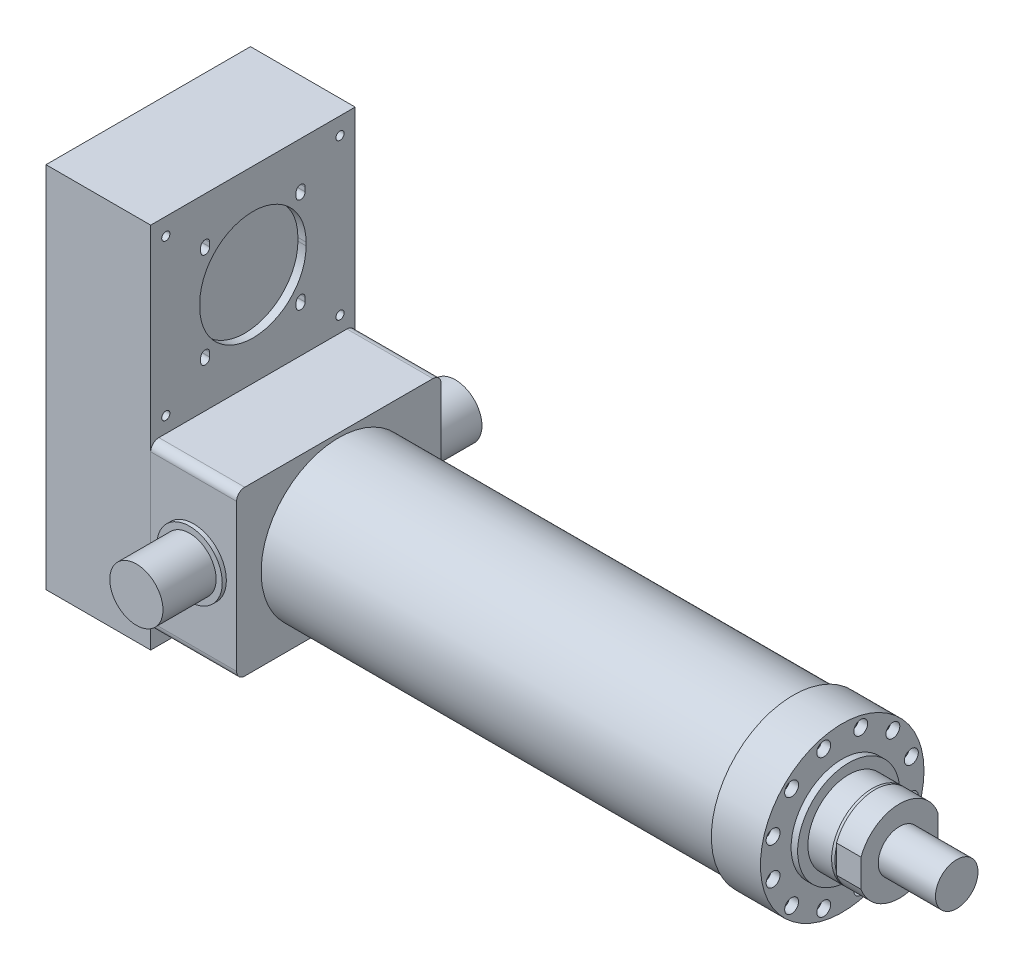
ISO-10303-21;
HEADER;
FILE_DESCRIPTION(('STEP AP214'),'2;1');
FILE_NAME('part.step','',(''),(''),'','','');
FILE_SCHEMA(('AUTOMOTIVE_DESIGN { 1 0 10303 214 1 1 1 1 }'));
ENDSEC;
DATA;
#1=APPLICATION_CONTEXT('core data for automotive mechanical design processes');
#2=APPLICATION_PROTOCOL_DEFINITION('international standard','automotive_design',2000,#1);
#3=PRODUCT_CONTEXT('',#1,'mechanical');
#4=PRODUCT('Part','Part','',(#3));
#5=PRODUCT_RELATED_PRODUCT_CATEGORY('part','',(#4));
#6=PRODUCT_DEFINITION_FORMATION('','',#4);
#7=PRODUCT_DEFINITION_CONTEXT('part definition',#1,'design');
#8=PRODUCT_DEFINITION('design','',#6,#7);
#9=PRODUCT_DEFINITION_SHAPE('','',#8);
#10=(LENGTH_UNIT() NAMED_UNIT(*) SI_UNIT(.MILLI.,.METRE.));
#11=(NAMED_UNIT(*) PLANE_ANGLE_UNIT() SI_UNIT($,.RADIAN.));
#12=(NAMED_UNIT(*) SI_UNIT($,.STERADIAN.) SOLID_ANGLE_UNIT());
#13=UNCERTAINTY_MEASURE_WITH_UNIT(LENGTH_MEASURE(1.E-05),#10,'distance_accuracy_value','');
#14=(GEOMETRIC_REPRESENTATION_CONTEXT(3) GLOBAL_UNCERTAINTY_ASSIGNED_CONTEXT((#13)) GLOBAL_UNIT_ASSIGNED_CONTEXT((#10,
#11,#12)) REPRESENTATION_CONTEXT('',''));
#15=CARTESIAN_POINT('',(0.,0.,0.));
#16=DIRECTION('',(0.,0.,1.));
#17=DIRECTION('',(1.,0.,0.));
#18=AXIS2_PLACEMENT_3D('',#15,#16,#17);
#19=CARTESIAN_POINT('',(-52.5,0.,-195.));
#20=DIRECTION('',(0.,0.,1.));
#21=DIRECTION('',(1.,0.,0.));
#22=AXIS2_PLACEMENT_3D('',#19,#20,#21);
#23=CYLINDRICAL_SURFACE('',#22,32.5);
#24=CARTESIAN_POINT('',(-52.5,0.,-195.));
#25=DIRECTION('',(0.,0.,1.));
#26=DIRECTION('',(1.,0.,0.));
#27=AXIS2_PLACEMENT_3D('',#24,#25,#26);
#28=CIRCLE('',#27,32.5);
#29=CARTESIAN_POINT('',(-20.,0.,-195.));
#30=VERTEX_POINT('',#29);
#31=EDGE_CURVE('E13',#30,#30,#28,.T.);
#32=ORIENTED_EDGE('',*,*,#31,.T.);
#33=EDGE_LOOP('',(#32));
#34=FACE_BOUND('',#33,.T.);
#35=CARTESIAN_POINT('',(-52.5,0.,-130.));
#36=DIRECTION('',(0.,0.,1.));
#37=DIRECTION('',(1.,0.,0.));
#38=AXIS2_PLACEMENT_3D('',#35,#36,#37);
#39=CIRCLE('',#38,32.5);
#40=CARTESIAN_POINT('',(-20.,0.,-130.));
#41=VERTEX_POINT('',#40);
#42=EDGE_CURVE('E271',#41,#41,#39,.T.);
#43=ORIENTED_EDGE('',*,*,#42,.F.);
#44=EDGE_LOOP('',(#43));
#45=FACE_BOUND('',#44,.T.);
#46=ADVANCED_FACE('F141',(#34,#45),#23,.T.);
#47=CARTESIAN_POINT('',(-52.5,0.,-195.));
#48=DIRECTION('',(0.,0.,1.));
#49=DIRECTION('',(1.,0.,0.));
#50=AXIS2_PLACEMENT_3D('',#47,#48,#49);
#51=PLANE('',#50);
#52=ORIENTED_EDGE('',*,*,#31,.F.);
#53=EDGE_LOOP('',(#52));
#54=FACE_BOUND('',#53,.T.);
#55=ADVANCED_FACE('F283',(#54),#51,.F.);
#56=CARTESIAN_POINT('',(-52.5,0.,-130.));
#57=DIRECTION('',(0.,0.,1.));
#58=DIRECTION('',(1.,0.,0.));
#59=AXIS2_PLACEMENT_3D('',#56,#57,#58);
#60=CYLINDRICAL_SURFACE('',#59,40.);
#61=CARTESIAN_POINT('',(-52.5,0.,-130.));
#62=DIRECTION('',(0.,0.,1.));
#63=DIRECTION('',(1.,0.,0.));
#64=AXIS2_PLACEMENT_3D('',#61,#62,#63);
#65=CIRCLE('',#64,40.);
#66=CARTESIAN_POINT('',(-12.5,0.,-130.));
#67=VERTEX_POINT('',#66);
#68=EDGE_CURVE('E149',#67,#67,#65,.T.);
#69=ORIENTED_EDGE('',*,*,#68,.T.);
#70=EDGE_LOOP('',(#69));
#71=FACE_BOUND('',#70,.T.);
#72=CARTESIAN_POINT('',(-52.5,0.,-125.));
#73=DIRECTION('',(0.,0.,1.));
#74=DIRECTION('',(1.,0.,0.));
#75=AXIS2_PLACEMENT_3D('',#72,#73,#74);
#76=CIRCLE('',#75,40.);
#77=CARTESIAN_POINT('',(-12.5,0.,-125.));
#78=VERTEX_POINT('',#77);
#79=EDGE_CURVE('E274',#78,#78,#76,.T.);
#80=ORIENTED_EDGE('',*,*,#79,.F.);
#81=EDGE_LOOP('',(#80));
#82=FACE_BOUND('',#81,.T.);
#83=ADVANCED_FACE('F280',(#71,#82),#60,.T.);
#84=CARTESIAN_POINT('',(-52.5,0.,-130.));
#85=DIRECTION('',(0.,0.,1.));
#86=DIRECTION('',(1.,0.,0.));
#87=AXIS2_PLACEMENT_3D('',#84,#85,#86);
#88=PLANE('',#87);
#89=ORIENTED_EDGE('',*,*,#42,.T.);
#90=EDGE_LOOP('',(#89));
#91=FACE_BOUND('',#90,.T.);
#92=ORIENTED_EDGE('',*,*,#68,.F.);
#93=EDGE_LOOP('',(#92));
#94=FACE_BOUND('',#93,.T.);
#95=ADVANCED_FACE('F282',(#91,#94),#88,.F.);
#96=CARTESIAN_POINT('',(-105.,-90.,115.));
#97=DIRECTION('',(1.,0.,0.));
#98=DIRECTION('',(0.,0.,-1.));
#99=AXIS2_PLACEMENT_3D('',#96,#97,#98);
#100=CYLINDRICAL_SURFACE('',#99,9.99999999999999);
#101=CARTESIAN_POINT('',(0.,-90.,115.));
#102=DIRECTION('',(-1.,0.,0.));
#103=DIRECTION('',(0.,0.,-1.));
#104=AXIS2_PLACEMENT_3D('',#101,#102,#103);
#105=CIRCLE('',#104,9.99999999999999);
#106=CARTESIAN_POINT('',(0.,-100.,115.));
#107=VERTEX_POINT('',#106);
#108=CARTESIAN_POINT('',(0.,-90.,125.));
#109=VERTEX_POINT('',#108);
#110=EDGE_CURVE('E238',#107,#109,#105,.T.);
#111=ORIENTED_EDGE('',*,*,#110,.T.);
#112=DIRECTION('',(1.,0.,0.));
#113=VECTOR('',#112,1.);
#114=CARTESIAN_POINT('',(-105.,-90.,125.));
#115=LINE('',#114,#113);
#116=CARTESIAN_POINT('',(-105.,-90.,125.));
#117=VERTEX_POINT('',#116);
#118=EDGE_CURVE('E266',#117,#109,#115,.T.);
#119=ORIENTED_EDGE('',*,*,#118,.F.);
#120=CARTESIAN_POINT('',(-105.,-90.,115.));
#121=DIRECTION('',(-1.,0.,0.));
#122=DIRECTION('',(0.,0.,-1.));
#123=AXIS2_PLACEMENT_3D('',#120,#121,#122);
#124=CIRCLE('',#123,9.99999999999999);
#125=CARTESIAN_POINT('',(-105.,-100.,115.));
#126=VERTEX_POINT('',#125);
#127=EDGE_CURVE('E253',#126,#117,#124,.T.);
#128=ORIENTED_EDGE('',*,*,#127,.F.);
#129=DIRECTION('',(1.,0.,0.));
#130=VECTOR('',#129,1.);
#131=CARTESIAN_POINT('',(-105.,-100.,115.));
#132=LINE('',#131,#130);
#133=EDGE_CURVE('E234',#126,#107,#132,.T.);
#134=ORIENTED_EDGE('',*,*,#133,.T.);
#135=EDGE_LOOP('',(#111,#119,#128,#134));
#136=FACE_BOUND('',#135,.T.);
#137=ADVANCED_FACE('F290',(#136),#100,.T.);
#138=CARTESIAN_POINT('',(-105.,90.,125.));
#139=DIRECTION('',(0.,0.,-1.));
#140=DIRECTION('',(0.,1.,0.));
#141=AXIS2_PLACEMENT_3D('',#138,#139,#140);
#142=PLANE('',#141);
#143=CARTESIAN_POINT('',(-52.5,0.,125.));
#144=DIRECTION('',(0.,0.,-1.));
#145=DIRECTION('',(0.,1.,0.));
#146=AXIS2_PLACEMENT_3D('',#143,#144,#145);
#147=CIRCLE('',#146,40.);
#148=CARTESIAN_POINT('',(-52.5,40.,125.));
#149=VERTEX_POINT('',#148);
#150=EDGE_CURVE('E268',#149,#149,#147,.F.);
#151=ORIENTED_EDGE('',*,*,#150,.F.);
#152=EDGE_LOOP('',(#151));
#153=FACE_BOUND('',#152,.T.);
#154=DIRECTION('',(0.,1.,0.));
#155=VECTOR('',#154,1.);
#156=CARTESIAN_POINT('',(0.,90.,125.));
#157=LINE('',#156,#155);
#158=CARTESIAN_POINT('',(0.,90.,125.));
#159=VERTEX_POINT('',#158);
#160=EDGE_CURVE('E241',#109,#159,#157,.T.);
#161=ORIENTED_EDGE('',*,*,#160,.T.);
#162=DIRECTION('',(1.,0.,0.));
#163=VECTOR('',#162,1.);
#164=CARTESIAN_POINT('',(-105.,90.,125.));
#165=LINE('',#164,#163);
#166=CARTESIAN_POINT('',(-105.,90.,125.));
#167=VERTEX_POINT('',#166);
#168=EDGE_CURVE('E263',#167,#159,#165,.T.);
#169=ORIENTED_EDGE('',*,*,#168,.F.);
#170=DIRECTION('',(0.,1.,0.));
#171=VECTOR('',#170,1.);
#172=CARTESIAN_POINT('',(-105.,90.,125.));
#173=LINE('',#172,#171);
#174=EDGE_CURVE('E201',#117,#167,#173,.T.);
#175=ORIENTED_EDGE('',*,*,#174,.F.);
#176=ORIENTED_EDGE('',*,*,#118,.T.);
#177=EDGE_LOOP('',(#161,#169,#175,#176));
#178=FACE_BOUND('',#177,.T.);
#179=ADVANCED_FACE('F319',(#153,#178),#142,.F.);
#180=CARTESIAN_POINT('',(-105.,90.,115.));
#181=DIRECTION('',(1.,0.,0.));
#182=DIRECTION('',(0.,0.,-1.));
#183=AXIS2_PLACEMENT_3D('',#180,#181,#182);
#184=CYLINDRICAL_SURFACE('',#183,10.);
#185=CARTESIAN_POINT('',(0.,90.,115.));
#186=DIRECTION('',(-1.,0.,0.));
#187=DIRECTION('',(0.,0.,1.));
#188=AXIS2_PLACEMENT_3D('',#185,#186,#187);
#189=CIRCLE('',#188,10.);
#190=CARTESIAN_POINT('',(0.,100.,115.));
#191=VERTEX_POINT('',#190);
#192=EDGE_CURVE('E244',#159,#191,#189,.T.);
#193=ORIENTED_EDGE('',*,*,#192,.T.);
#194=DIRECTION('',(1.,0.,0.));
#195=VECTOR('',#194,1.);
#196=CARTESIAN_POINT('',(-105.,100.,115.));
#197=LINE('',#196,#195);
#198=CARTESIAN_POINT('',(-105.,100.,115.));
#199=VERTEX_POINT('',#198);
#200=EDGE_CURVE('E260',#199,#191,#197,.T.);
#201=ORIENTED_EDGE('',*,*,#200,.F.);
#202=CARTESIAN_POINT('',(-105.,90.,115.));
#203=DIRECTION('',(-1.,0.,0.));
#204=DIRECTION('',(0.,0.,1.));
#205=AXIS2_PLACEMENT_3D('',#202,#203,#204);
#206=CIRCLE('',#205,10.);
#207=EDGE_CURVE('E468',#167,#199,#206,.T.);
#208=ORIENTED_EDGE('',*,*,#207,.F.);
#209=ORIENTED_EDGE('',*,*,#168,.T.);
#210=EDGE_LOOP('',(#193,#201,#208,#209));
#211=FACE_BOUND('',#210,.T.);
#212=ADVANCED_FACE('F329',(#211),#184,.T.);
#213=CARTESIAN_POINT('',(-105.,100.,-115.));
#214=DIRECTION('',(0.,-1.,0.));
#215=DIRECTION('',(0.,0.,-1.));
#216=AXIS2_PLACEMENT_3D('',#213,#214,#215);
#217=PLANE('',#216);
#218=DIRECTION('',(0.,0.,-1.));
#219=VECTOR('',#218,1.);
#220=CARTESIAN_POINT('',(0.,100.,-115.));
#221=LINE('',#220,#219);
#222=CARTESIAN_POINT('',(0.,100.,-115.));
#223=VERTEX_POINT('',#222);
#224=EDGE_CURVE('E246',#191,#223,#221,.T.);
#225=ORIENTED_EDGE('',*,*,#224,.T.);
#226=DIRECTION('',(1.,0.,0.));
#227=VECTOR('',#226,1.);
#228=CARTESIAN_POINT('',(-105.,100.,-115.));
#229=LINE('',#228,#227);
#230=CARTESIAN_POINT('',(-105.,100.,-115.));
#231=VERTEX_POINT('',#230);
#232=EDGE_CURVE('E257',#231,#223,#229,.T.);
#233=ORIENTED_EDGE('',*,*,#232,.F.);
#234=DIRECTION('',(0.,0.,-1.));
#235=VECTOR('',#234,1.);
#236=CARTESIAN_POINT('',(-105.,100.,-115.));
#237=LINE('',#236,#235);
#238=EDGE_CURVE('E470',#199,#231,#237,.T.);
#239=ORIENTED_EDGE('',*,*,#238,.F.);
#240=ORIENTED_EDGE('',*,*,#200,.T.);
#241=EDGE_LOOP('',(#225,#233,#239,#240));
#242=FACE_BOUND('',#241,.T.);
#243=ADVANCED_FACE('F338',(#242),#217,.F.);
#244=CARTESIAN_POINT('',(-105.,90.,-115.));
#245=DIRECTION('',(1.,0.,0.));
#246=DIRECTION('',(0.,0.,-1.));
#247=AXIS2_PLACEMENT_3D('',#244,#245,#246);
#248=CYLINDRICAL_SURFACE('',#247,9.99999999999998);
#249=CARTESIAN_POINT('',(0.,90.,-115.));
#250=DIRECTION('',(-1.,0.,0.));
#251=DIRECTION('',(0.,0.,-1.));
#252=AXIS2_PLACEMENT_3D('',#249,#250,#251);
#253=CIRCLE('',#252,9.99999999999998);
#254=CARTESIAN_POINT('',(0.,90.,-125.));
#255=VERTEX_POINT('',#254);
#256=EDGE_CURVE('E248',#223,#255,#253,.T.);
#257=ORIENTED_EDGE('',*,*,#256,.T.);
#258=DIRECTION('',(1.,0.,0.));
#259=VECTOR('',#258,1.);
#260=CARTESIAN_POINT('',(-105.,90.,-125.));
#261=LINE('',#260,#259);
#262=CARTESIAN_POINT('',(-105.,90.,-125.));
#263=VERTEX_POINT('',#262);
#264=EDGE_CURVE('E229',#263,#255,#261,.T.);
#265=ORIENTED_EDGE('',*,*,#264,.F.);
#266=CARTESIAN_POINT('',(-105.,90.,-115.));
#267=DIRECTION('',(-1.,0.,0.));
#268=DIRECTION('',(0.,0.,-1.));
#269=AXIS2_PLACEMENT_3D('',#266,#267,#268);
#270=CIRCLE('',#269,9.99999999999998);
#271=EDGE_CURVE('E220',#231,#263,#270,.T.);
#272=ORIENTED_EDGE('',*,*,#271,.F.);
#273=ORIENTED_EDGE('',*,*,#232,.T.);
#274=EDGE_LOOP('',(#257,#265,#272,#273));
#275=FACE_BOUND('',#274,.T.);
#276=ADVANCED_FACE('F347',(#275),#248,.T.);
#277=CARTESIAN_POINT('',(-105.,90.,-125.));
#278=DIRECTION('',(0.,0.,1.));
#279=DIRECTION('',(0.,-1.,0.));
#280=AXIS2_PLACEMENT_3D('',#277,#278,#279);
#281=PLANE('',#280);
#282=ORIENTED_EDGE('',*,*,#79,.T.);
#283=EDGE_LOOP('',(#282));
#284=FACE_BOUND('',#283,.T.);
#285=DIRECTION('',(0.,-1.,0.));
#286=VECTOR('',#285,1.);
#287=CARTESIAN_POINT('',(0.,90.,-125.));
#288=LINE('',#287,#286);
#289=CARTESIAN_POINT('',(0.,-90.,-125.));
#290=VERTEX_POINT('',#289);
#291=EDGE_CURVE('E228',#255,#290,#288,.T.);
#292=ORIENTED_EDGE('',*,*,#291,.T.);
#293=DIRECTION('',(1.,0.,0.));
#294=VECTOR('',#293,1.);
#295=CARTESIAN_POINT('',(-105.,-90.,-125.));
#296=LINE('',#295,#294);
#297=CARTESIAN_POINT('',(-105.,-90.,-125.));
#298=VERTEX_POINT('',#297);
#299=EDGE_CURVE('E225',#298,#290,#296,.T.);
#300=ORIENTED_EDGE('',*,*,#299,.F.);
#301=DIRECTION('',(0.,-1.,0.));
#302=VECTOR('',#301,1.);
#303=CARTESIAN_POINT('',(-105.,90.,-125.));
#304=LINE('',#303,#302);
#305=EDGE_CURVE('E214',#263,#298,#304,.T.);
#306=ORIENTED_EDGE('',*,*,#305,.F.);
#307=ORIENTED_EDGE('',*,*,#264,.T.);
#308=EDGE_LOOP('',(#292,#300,#306,#307));
#309=FACE_BOUND('',#308,.T.);
#310=ADVANCED_FACE('F226',(#284,#309),#281,.F.);
#311=CARTESIAN_POINT('',(-105.,-90.,-115.));
#312=DIRECTION('',(1.,0.,0.));
#313=DIRECTION('',(0.,0.,-1.));
#314=AXIS2_PLACEMENT_3D('',#311,#312,#313);
#315=CYLINDRICAL_SURFACE('',#314,9.99999999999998);
#316=CARTESIAN_POINT('',(0.,-90.,-115.));
#317=DIRECTION('',(-1.,0.,0.));
#318=DIRECTION('',(0.,0.,-1.));
#319=AXIS2_PLACEMENT_3D('',#316,#317,#318);
#320=CIRCLE('',#319,9.99999999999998);
#321=CARTESIAN_POINT('',(0.,-100.,-115.));
#322=VERTEX_POINT('',#321);
#323=EDGE_CURVE('E186',#290,#322,#320,.T.);
#324=ORIENTED_EDGE('',*,*,#323,.T.);
#325=DIRECTION('',(1.,0.,0.));
#326=VECTOR('',#325,1.);
#327=CARTESIAN_POINT('',(-105.,-100.,-115.));
#328=LINE('',#327,#326);
#329=CARTESIAN_POINT('',(-105.,-100.,-115.));
#330=VERTEX_POINT('',#329);
#331=EDGE_CURVE('E230',#330,#322,#328,.T.);
#332=ORIENTED_EDGE('',*,*,#331,.F.);
#333=CARTESIAN_POINT('',(-105.,-90.,-115.));
#334=DIRECTION('',(-1.,0.,0.));
#335=DIRECTION('',(0.,0.,-1.));
#336=AXIS2_PLACEMENT_3D('',#333,#334,#335);
#337=CIRCLE('',#336,9.99999999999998);
#338=EDGE_CURVE('E218',#298,#330,#337,.T.);
#339=ORIENTED_EDGE('',*,*,#338,.F.);
#340=ORIENTED_EDGE('',*,*,#299,.T.);
#341=EDGE_LOOP('',(#324,#332,#339,#340));
#342=FACE_BOUND('',#341,.T.);
#343=ADVANCED_FACE('F232',(#342),#315,.T.);
#344=CARTESIAN_POINT('',(-105.,-100.,-115.));
#345=DIRECTION('',(0.,1.,0.));
#346=DIRECTION('',(0.,0.,1.));
#347=AXIS2_PLACEMENT_3D('',#344,#345,#346);
#348=PLANE('',#347);
#349=DIRECTION('',(0.,0.,1.));
#350=VECTOR('',#349,1.);
#351=CARTESIAN_POINT('',(0.,-100.,-115.));
#352=LINE('',#351,#350);
#353=EDGE_CURVE('E192',#322,#107,#352,.T.);
#354=ORIENTED_EDGE('',*,*,#353,.T.);
#355=ORIENTED_EDGE('',*,*,#133,.F.);
#356=DIRECTION('',(0.,0.,1.));
#357=VECTOR('',#356,1.);
#358=CARTESIAN_POINT('',(-105.,-100.,-115.));
#359=LINE('',#358,#357);
#360=EDGE_CURVE('E157',#330,#126,#359,.T.);
#361=ORIENTED_EDGE('',*,*,#360,.F.);
#362=ORIENTED_EDGE('',*,*,#331,.T.);
#363=EDGE_LOOP('',(#354,#355,#361,#362));
#364=FACE_BOUND('',#363,.T.);
#365=ADVANCED_FACE('F371',(#364),#348,.F.);
#366=CARTESIAN_POINT('',(-105.,-90.,115.));
#367=DIRECTION('',(1.,0.,0.));
#368=DIRECTION('',(0.,0.,-1.));
#369=AXIS2_PLACEMENT_3D('',#366,#367,#368);
#370=PLANE('',#369);
#371=ORIENTED_EDGE('',*,*,#127,.T.);
#372=ORIENTED_EDGE('',*,*,#174,.T.);
#373=ORIENTED_EDGE('',*,*,#207,.T.);
#374=ORIENTED_EDGE('',*,*,#238,.T.);
#375=ORIENTED_EDGE('',*,*,#271,.T.);
#376=ORIENTED_EDGE('',*,*,#305,.T.);
#377=ORIENTED_EDGE('',*,*,#338,.T.);
#378=ORIENTED_EDGE('',*,*,#360,.T.);
#379=EDGE_LOOP('',(#371,#372,#373,#374,#375,#376,#377,#378));
#380=FACE_BOUND('',#379,.T.);
#381=ADVANCED_FACE('F216',(#380),#370,.F.);
#382=CARTESIAN_POINT('',(0.,-90.,115.));
#383=DIRECTION('',(1.,0.,0.));
#384=DIRECTION('',(0.,0.,-1.));
#385=AXIS2_PLACEMENT_3D('',#382,#383,#384);
#386=PLANE('',#385);
#387=ORIENTED_EDGE('',*,*,#110,.F.);
#388=ORIENTED_EDGE('',*,*,#353,.F.);
#389=ORIENTED_EDGE('',*,*,#323,.F.);
#390=ORIENTED_EDGE('',*,*,#291,.F.);
#391=ORIENTED_EDGE('',*,*,#256,.F.);
#392=ORIENTED_EDGE('',*,*,#224,.F.);
#393=ORIENTED_EDGE('',*,*,#192,.F.);
#394=ORIENTED_EDGE('',*,*,#160,.F.);
#395=EDGE_LOOP('',(#387,#388,#389,#390,#391,#392,#393,#394));
#396=FACE_BOUND('',#395,.T.);
#397=ADVANCED_FACE('F386',(#396),#386,.T.);
#398=CARTESIAN_POINT('',(-52.5,0.,130.));
#399=DIRECTION('',(0.,0.,1.));
#400=DIRECTION('',(1.,0.,0.));
#401=AXIS2_PLACEMENT_3D('',#398,#399,#400);
#402=PLANE('',#401);
#403=CARTESIAN_POINT('',(-52.5,0.,130.));
#404=DIRECTION('',(0.,0.,1.));
#405=DIRECTION('',(1.,0.,0.));
#406=AXIS2_PLACEMENT_3D('',#403,#404,#405);
#407=CIRCLE('',#406,40.);
#408=CARTESIAN_POINT('',(-12.5,0.,130.));
#409=VERTEX_POINT('',#408);
#410=EDGE_CURVE('E242',#409,#409,#407,.T.);
#411=ORIENTED_EDGE('',*,*,#410,.T.);
#412=EDGE_LOOP('',(#411));
#413=FACE_BOUND('',#412,.T.);
#414=CARTESIAN_POINT('',(-52.5,0.,130.));
#415=DIRECTION('',(0.,0.,1.));
#416=DIRECTION('',(1.,0.,0.));
#417=AXIS2_PLACEMENT_3D('',#414,#415,#416);
#418=CIRCLE('',#417,32.5);
#419=CARTESIAN_POINT('',(-20.,0.,130.));
#420=VERTEX_POINT('',#419);
#421=EDGE_CURVE('E459',#420,#420,#418,.T.);
#422=ORIENTED_EDGE('',*,*,#421,.F.);
#423=EDGE_LOOP('',(#422));
#424=FACE_BOUND('',#423,.T.);
#425=ADVANCED_FACE('F394',(#413,#424),#402,.T.);
#426=CARTESIAN_POINT('',(-52.5,0.,130.));
#427=DIRECTION('',(0.,0.,-1.));
#428=DIRECTION('',(-1.,0.,0.));
#429=AXIS2_PLACEMENT_3D('',#426,#427,#428);
#430=CYLINDRICAL_SURFACE('',#429,40.);
#431=ORIENTED_EDGE('',*,*,#410,.F.);
#432=EDGE_LOOP('',(#431));
#433=FACE_BOUND('',#432,.T.);
#434=ORIENTED_EDGE('',*,*,#150,.T.);
#435=EDGE_LOOP('',(#434));
#436=FACE_BOUND('',#435,.T.);
#437=ADVANCED_FACE('F403',(#433,#436),#430,.T.);
#438=CARTESIAN_POINT('',(-52.5,0.,195.));
#439=DIRECTION('',(0.,0.,-1.));
#440=DIRECTION('',(-1.,0.,0.));
#441=AXIS2_PLACEMENT_3D('',#438,#439,#440);
#442=CYLINDRICAL_SURFACE('',#441,32.5);
#443=ORIENTED_EDGE('',*,*,#421,.T.);
#444=EDGE_LOOP('',(#443));
#445=FACE_BOUND('',#444,.T.);
#446=CARTESIAN_POINT('',(-52.5,0.,195.));
#447=DIRECTION('',(0.,0.,1.));
#448=DIRECTION('',(1.,0.,0.));
#449=AXIS2_PLACEMENT_3D('',#446,#447,#448);
#450=CIRCLE('',#449,32.5);
#451=CARTESIAN_POINT('',(-20.,0.,195.));
#452=VERTEX_POINT('',#451);
#453=EDGE_CURVE('E457',#452,#452,#450,.T.);
#454=ORIENTED_EDGE('',*,*,#453,.F.);
#455=EDGE_LOOP('',(#454));
#456=FACE_BOUND('',#455,.T.);
#457=ADVANCED_FACE('F412',(#445,#456),#442,.T.);
#458=CARTESIAN_POINT('',(-52.5,0.,195.));
#459=DIRECTION('',(0.,0.,1.));
#460=DIRECTION('',(1.,0.,0.));
#461=AXIS2_PLACEMENT_3D('',#458,#459,#460);
#462=PLANE('',#461);
#463=ORIENTED_EDGE('',*,*,#453,.T.);
#464=EDGE_LOOP('',(#463));
#465=FACE_BOUND('',#464,.T.);
#466=ADVANCED_FACE('F421',(#465),#462,.T.);
#467=CLOSED_SHELL('',(#46,#55,#83,#95,#137,#179,#212,#243,#276,#310,#343,#365,#381,#397,#425,
#437,#457,#466));
#468=MANIFOLD_SOLID_BREP('B2',#467);
#469=CARTESIAN_POINT('',(755.5,0.,0.));
#470=DIRECTION('',(-1.,0.,0.));
#471=DIRECTION('',(0.,0.,1.));
#472=AXIS2_PLACEMENT_3D('',#469,#470,#471);
#473=CYLINDRICAL_SURFACE('',#472,26.);
#474=CARTESIAN_POINT('',(755.5,0.,0.));
#475=DIRECTION('',(1.,0.,0.));
#476=DIRECTION('',(0.,0.,-1.));
#477=AXIS2_PLACEMENT_3D('',#474,#475,#476);
#478=CIRCLE('',#477,26.);
#479=CARTESIAN_POINT('',(755.5,0.,-26.));
#480=VERTEX_POINT('',#479);
#481=EDGE_CURVE('E140',#480,#480,#478,.T.);
#482=ORIENTED_EDGE('',*,*,#481,.F.);
#483=EDGE_LOOP('',(#482));
#484=FACE_BOUND('',#483,.T.);
#485=CARTESIAN_POINT('',(685.5,0.,0.));
#486=DIRECTION('',(1.,0.,0.));
#487=DIRECTION('',(0.,0.,-1.));
#488=AXIS2_PLACEMENT_3D('',#485,#486,#487);
#489=CIRCLE('',#488,26.);
#490=CARTESIAN_POINT('',(685.5,0.,-26.));
#491=VERTEX_POINT('',#490);
#492=EDGE_CURVE('E501',#491,#491,#489,.T.);
#493=ORIENTED_EDGE('',*,*,#492,.T.);
#494=EDGE_LOOP('',(#493));
#495=FACE_BOUND('',#494,.T.);
#496=ADVANCED_FACE('F498',(#484,#495),#473,.T.);
#497=CARTESIAN_POINT('',(755.5,0.,0.));
#498=DIRECTION('',(1.,0.,0.));
#499=DIRECTION('',(0.,0.,-1.));
#500=AXIS2_PLACEMENT_3D('',#497,#498,#499);
#501=PLANE('',#500);
#502=ORIENTED_EDGE('',*,*,#481,.T.);
#503=EDGE_LOOP('',(#502));
#504=FACE_BOUND('',#503,.T.);
#505=ADVANCED_FACE('F513',(#504),#501,.T.);
#506=CARTESIAN_POINT('',(685.5,0.,0.));
#507=DIRECTION('',(1.,0.,0.));
#508=DIRECTION('',(0.,0.,-1.));
#509=AXIS2_PLACEMENT_3D('',#506,#507,#508);
#510=PLANE('',#509);
#511=ORIENTED_EDGE('',*,*,#492,.F.);
#512=EDGE_LOOP('',(#511));
#513=FACE_BOUND('',#512,.T.);
#514=ADVANCED_FACE('F511',(#513),#510,.F.);
#515=CLOSED_SHELL('',(#496,#505,#514));
#516=MANIFOLD_SOLID_BREP('B7',#515);
#517=CARTESIAN_POINT('',(-105.,0.,0.));
#518=DIRECTION('',(-1.,0.,0.));
#519=DIRECTION('',(0.,0.,1.));
#520=AXIS2_PLACEMENT_3D('',#517,#518,#519);
#521=PLANE('',#520);
#522=DIRECTION('',(0.,1.,0.));
#523=VECTOR('',#522,1.);
#524=CARTESIAN_POINT('',(-105.,270.83630944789,63.8363094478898));
#525=LINE('',#524,#523);
#526=CARTESIAN_POINT('',(-105.,270.83630944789,63.8363094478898));
#527=VERTEX_POINT('',#526);
#528=CARTESIAN_POINT('',(-105.,275.836309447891,63.8363094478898));
#529=VERTEX_POINT('',#528);
#530=EDGE_CURVE('E570',#527,#529,#525,.T.);
#531=ORIENTED_EDGE('',*,*,#530,.T.);
#532=CARTESIAN_POINT('',(-105.,275.836309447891,58.3363094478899));
#533=DIRECTION('',(1.,0.,0.));
#534=DIRECTION('',(0.,0.,-1.));
#535=AXIS2_PLACEMENT_3D('',#532,#533,#534);
#536=CIRCLE('',#535,5.49999999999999);
#537=CARTESIAN_POINT('',(-105.,275.836309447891,52.8363094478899));
#538=VERTEX_POINT('',#537);
#539=EDGE_CURVE('E807',#538,#529,#536,.T.);
#540=ORIENTED_EDGE('',*,*,#539,.F.);
#541=DIRECTION('',(0.,1.,0.));
#542=VECTOR('',#541,1.);
#543=CARTESIAN_POINT('',(-105.,270.83630944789,52.8363094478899));
#544=LINE('',#543,#542);
#545=CARTESIAN_POINT('',(-105.,270.83630944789,52.8363094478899));
#546=VERTEX_POINT('',#545);
#547=EDGE_CURVE('E803',#546,#538,#544,.T.);
#548=ORIENTED_EDGE('',*,*,#547,.F.);
#549=CARTESIAN_POINT('',(-105.,270.83630944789,58.3363094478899));
#550=DIRECTION('',(1.,0.,0.));
#551=DIRECTION('',(0.,0.,-1.));
#552=AXIS2_PLACEMENT_3D('',#549,#550,#551);
#553=CIRCLE('',#552,5.49999999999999);
#554=EDGE_CURVE('E800',#527,#546,#553,.T.);
#555=ORIENTED_EDGE('',*,*,#554,.F.);
#556=EDGE_LOOP('',(#531,#540,#548,#555));
#557=FACE_BOUND('',#556,.T.);
#558=CARTESIAN_POINT('',(-105.,213.,0.));
#559=DIRECTION('',(1.,0.,0.));
#560=DIRECTION('',(0.,0.,-1.));
#561=AXIS2_PLACEMENT_3D('',#558,#559,#560);
#562=CIRCLE('',#561,65.);
#563=CARTESIAN_POINT('',(-105.,213.,65.));
#564=VERTEX_POINT('',#563);
#565=CARTESIAN_POINT('',(-105.,213.,-65.));
#566=VERTEX_POINT('',#565);
#567=EDGE_CURVE('E870',#564,#566,#562,.T.);
#568=ORIENTED_EDGE('',*,*,#567,.F.);
#569=DIRECTION('',(0.,-1.,0.));
#570=VECTOR('',#569,1.);
#571=CARTESIAN_POINT('',(-105.,217.,65.));
#572=LINE('',#571,#570);
#573=CARTESIAN_POINT('',(-105.,217.,65.));
#574=VERTEX_POINT('',#573);
#575=EDGE_CURVE('E853',#574,#564,#572,.T.);
#576=ORIENTED_EDGE('',*,*,#575,.F.);
#577=CARTESIAN_POINT('',(-105.,217.,0.));
#578=DIRECTION('',(1.,0.,0.));
#579=DIRECTION('',(0.,0.,-1.));
#580=AXIS2_PLACEMENT_3D('',#577,#578,#579);
#581=CIRCLE('',#580,65.);
#582=CARTESIAN_POINT('',(-105.,217.,-65.));
#583=VERTEX_POINT('',#582);
#584=EDGE_CURVE('E863',#583,#574,#581,.T.);
#585=ORIENTED_EDGE('',*,*,#584,.F.);
#586=DIRECTION('',(0.,-1.,0.));
#587=VECTOR('',#586,1.);
#588=CARTESIAN_POINT('',(-105.,217.,-65.));
#589=LINE('',#588,#587);
#590=EDGE_CURVE('E866',#583,#566,#589,.T.);
#591=ORIENTED_EDGE('',*,*,#590,.T.);
#592=EDGE_LOOP('',(#568,#576,#585,#591));
#593=FACE_BOUND('',#592,.T.);
#594=CARTESIAN_POINT('',(-105.,119.,106.499999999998));
#595=DIRECTION('',(1.,0.,0.));
#596=DIRECTION('',(0.,0.,-1.));
#597=AXIS2_PLACEMENT_3D('',#594,#595,#596);
#598=CIRCLE('',#597,5.00000000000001);
#599=CARTESIAN_POINT('',(-105.,119.,101.499999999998));
#600=VERTEX_POINT('',#599);
#601=EDGE_CURVE('E846',#600,#600,#598,.T.);
#602=ORIENTED_EDGE('',*,*,#601,.F.);
#603=EDGE_LOOP('',(#602));
#604=FACE_BOUND('',#603,.T.);
#605=CARTESIAN_POINT('',(-105.,154.16369055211,-58.3363094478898));
#606=DIRECTION('',(1.,0.,0.));
#607=DIRECTION('',(0.,0.,-1.));
#608=AXIS2_PLACEMENT_3D('',#605,#606,#607);
#609=CIRCLE('',#608,5.49999999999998);
#610=CARTESIAN_POINT('',(-105.,154.16369055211,-52.8363094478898));
#611=VERTEX_POINT('',#610);
#612=CARTESIAN_POINT('',(-105.,154.16369055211,-63.8363094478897));
#613=VERTEX_POINT('',#612);
#614=EDGE_CURVE('E734',#611,#613,#609,.T.);
#615=ORIENTED_EDGE('',*,*,#614,.F.);
#616=DIRECTION('',(0.,-1.,0.));
#617=VECTOR('',#616,1.);
#618=CARTESIAN_POINT('',(-105.,159.16369055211,-52.8363094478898));
#619=LINE('',#618,#617);
#620=CARTESIAN_POINT('',(-105.,159.16369055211,-52.8363094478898));
#621=VERTEX_POINT('',#620);
#622=EDGE_CURVE('E713',#621,#611,#619,.T.);
#623=ORIENTED_EDGE('',*,*,#622,.F.);
#624=CARTESIAN_POINT('',(-105.,159.16369055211,-58.3363094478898));
#625=DIRECTION('',(1.,0.,0.));
#626=DIRECTION('',(0.,0.,-1.));
#627=AXIS2_PLACEMENT_3D('',#624,#625,#626);
#628=CIRCLE('',#627,5.5);
#629=CARTESIAN_POINT('',(-105.,159.16369055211,-63.8363094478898));
#630=VERTEX_POINT('',#629);
#631=EDGE_CURVE('E724',#630,#621,#628,.T.);
#632=ORIENTED_EDGE('',*,*,#631,.F.);
#633=DIRECTION('',(0.,-1.,0.));
#634=VECTOR('',#633,1.);
#635=CARTESIAN_POINT('',(-105.,159.16369055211,-63.8363094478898));
#636=LINE('',#635,#634);
#637=EDGE_CURVE('E729',#630,#613,#636,.T.);
#638=ORIENTED_EDGE('',*,*,#637,.T.);
#639=EDGE_LOOP('',(#615,#623,#632,#638));
#640=FACE_BOUND('',#639,.T.);
#641=CARTESIAN_POINT('',(-105.,275.836309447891,-58.3363094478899));
#642=DIRECTION('',(-1.,0.,0.));
#643=DIRECTION('',(0.,0.,1.));
#644=AXIS2_PLACEMENT_3D('',#641,#642,#643);
#645=CIRCLE('',#644,5.49999999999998);
#646=CARTESIAN_POINT('',(-105.,275.836309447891,-52.8363094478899));
#647=VERTEX_POINT('',#646);
#648=CARTESIAN_POINT('',(-105.,275.836309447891,-63.8363094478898));
#649=VERTEX_POINT('',#648);
#650=EDGE_CURVE('E769',#647,#649,#645,.T.);
#651=ORIENTED_EDGE('',*,*,#650,.T.);
#652=DIRECTION('',(0.,1.,0.));
#653=VECTOR('',#652,1.);
#654=CARTESIAN_POINT('',(-105.,270.83630944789,-63.8363094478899));
#655=LINE('',#654,#653);
#656=CARTESIAN_POINT('',(-105.,270.83630944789,-63.8363094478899));
#657=VERTEX_POINT('',#656);
#658=EDGE_CURVE('E721',#657,#649,#655,.T.);
#659=ORIENTED_EDGE('',*,*,#658,.F.);
#660=CARTESIAN_POINT('',(-105.,270.83630944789,-58.3363094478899));
#661=DIRECTION('',(-1.,0.,0.));
#662=DIRECTION('',(0.,0.,1.));
#663=AXIS2_PLACEMENT_3D('',#660,#661,#662);
#664=CIRCLE('',#663,5.5);
#665=CARTESIAN_POINT('',(-105.,270.83630944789,-52.8363094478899));
#666=VERTEX_POINT('',#665);
#667=EDGE_CURVE('E762',#657,#666,#664,.T.);
#668=ORIENTED_EDGE('',*,*,#667,.T.);
#669=DIRECTION('',(0.,1.,0.));
#670=VECTOR('',#669,1.);
#671=CARTESIAN_POINT('',(-105.,270.83630944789,-52.8363094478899));
#672=LINE('',#671,#670);
#673=EDGE_CURVE('E765',#666,#647,#672,.T.);
#674=ORIENTED_EDGE('',*,*,#673,.T.);
#675=EDGE_LOOP('',(#651,#659,#668,#674));
#676=FACE_BOUND('',#675,.T.);
#677=CARTESIAN_POINT('',(-105.,119.,-106.500000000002));
#678=DIRECTION('',(1.,0.,0.));
#679=DIRECTION('',(0.,0.,-1.));
#680=AXIS2_PLACEMENT_3D('',#677,#678,#679);
#681=CIRCLE('',#680,5.00000000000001);
#682=CARTESIAN_POINT('',(-105.,119.,-111.500000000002));
#683=VERTEX_POINT('',#682);
#684=EDGE_CURVE('E761',#683,#683,#681,.T.);
#685=ORIENTED_EDGE('',*,*,#684,.F.);
#686=EDGE_LOOP('',(#685));
#687=FACE_BOUND('',#686,.T.);
#688=CARTESIAN_POINT('',(-105.,309.,-106.5));
#689=DIRECTION('',(1.,0.,0.));
#690=DIRECTION('',(0.,0.,-1.));
#691=AXIS2_PLACEMENT_3D('',#688,#689,#690);
#692=CIRCLE('',#691,5.00000000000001);
#693=CARTESIAN_POINT('',(-105.,309.,-111.5));
#694=VERTEX_POINT('',#693);
#695=EDGE_CURVE('E785',#694,#694,#692,.T.);
#696=ORIENTED_EDGE('',*,*,#695,.F.);
#697=EDGE_LOOP('',(#696));
#698=FACE_BOUND('',#697,.T.);
#699=CARTESIAN_POINT('',(-105.,309.,106.5));
#700=DIRECTION('',(1.,0.,0.));
#701=DIRECTION('',(0.,0.,-1.));
#702=AXIS2_PLACEMENT_3D('',#699,#700,#701);
#703=CIRCLE('',#702,5.00000000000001);
#704=CARTESIAN_POINT('',(-105.,309.,101.5));
#705=VERTEX_POINT('',#704);
#706=EDGE_CURVE('E849',#705,#705,#703,.T.);
#707=ORIENTED_EDGE('',*,*,#706,.F.);
#708=EDGE_LOOP('',(#707));
#709=FACE_BOUND('',#708,.T.);
#710=DIRECTION('',(0.,1.,0.));
#711=VECTOR('',#710,1.);
#712=CARTESIAN_POINT('',(-105.,330.,125.));
#713=LINE('',#712,#711);
#714=CARTESIAN_POINT('',(-105.,-120.,125.));
#715=VERTEX_POINT('',#714);
#716=CARTESIAN_POINT('',(-105.,330.,125.));
#717=VERTEX_POINT('',#716);
#718=EDGE_CURVE('E886',#715,#717,#713,.T.);
#719=ORIENTED_EDGE('',*,*,#718,.F.);
#720=DIRECTION('',(0.,0.,1.));
#721=VECTOR('',#720,1.);
#722=CARTESIAN_POINT('',(-105.,-120.,-125.));
#723=LINE('',#722,#721);
#724=CARTESIAN_POINT('',(-105.,-120.,-125.));
#725=VERTEX_POINT('',#724);
#726=EDGE_CURVE('E893',#725,#715,#723,.T.);
#727=ORIENTED_EDGE('',*,*,#726,.F.);
#728=DIRECTION('',(0.,-1.,0.));
#729=VECTOR('',#728,1.);
#730=CARTESIAN_POINT('',(-105.,330.,-125.));
#731=LINE('',#730,#729);
#732=CARTESIAN_POINT('',(-105.,330.,-125.));
#733=VERTEX_POINT('',#732);
#734=EDGE_CURVE('E904',#733,#725,#731,.T.);
#735=ORIENTED_EDGE('',*,*,#734,.F.);
#736=DIRECTION('',(0.,0.,-1.));
#737=VECTOR('',#736,1.);
#738=CARTESIAN_POINT('',(-105.,330.,-125.));
#739=LINE('',#738,#737);
#740=EDGE_CURVE('E902',#717,#733,#739,.T.);
#741=ORIENTED_EDGE('',*,*,#740,.F.);
#742=EDGE_LOOP('',(#719,#727,#735,#741));
#743=FACE_BOUND('',#742,.T.);
#744=DIRECTION('',(0.,-1.,0.));
#745=VECTOR('',#744,1.);
#746=CARTESIAN_POINT('',(-105.,159.16369055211,52.8363094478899));
#747=LINE('',#746,#745);
#748=CARTESIAN_POINT('',(-105.,159.16369055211,52.8363094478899));
#749=VERTEX_POINT('',#748);
#750=CARTESIAN_POINT('',(-105.,154.16369055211,52.8363094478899));
#751=VERTEX_POINT('',#750);
#752=EDGE_CURVE('E562',#749,#751,#747,.T.);
#753=ORIENTED_EDGE('',*,*,#752,.T.);
#754=CARTESIAN_POINT('',(-105.,154.16369055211,58.3363094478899));
#755=DIRECTION('',(-1.,0.,0.));
#756=DIRECTION('',(0.,0.,1.));
#757=AXIS2_PLACEMENT_3D('',#754,#755,#756);
#758=CIRCLE('',#757,5.49999999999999);
#759=CARTESIAN_POINT('',(-105.,154.16369055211,63.8363094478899));
#760=VERTEX_POINT('',#759);
#761=EDGE_CURVE('E834',#751,#760,#758,.T.);
#762=ORIENTED_EDGE('',*,*,#761,.T.);
#763=DIRECTION('',(0.,-1.,0.));
#764=VECTOR('',#763,1.);
#765=CARTESIAN_POINT('',(-105.,159.16369055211,63.8363094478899));
#766=LINE('',#765,#764);
#767=CARTESIAN_POINT('',(-105.,159.16369055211,63.8363094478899));
#768=VERTEX_POINT('',#767);
#769=EDGE_CURVE('E830',#768,#760,#766,.T.);
#770=ORIENTED_EDGE('',*,*,#769,.F.);
#771=CARTESIAN_POINT('',(-105.,159.16369055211,58.3363094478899));
#772=DIRECTION('',(-1.,0.,0.));
#773=DIRECTION('',(0.,0.,1.));
#774=AXIS2_PLACEMENT_3D('',#771,#772,#773);
#775=CIRCLE('',#774,5.49999999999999);
#776=EDGE_CURVE('E827',#768,#749,#775,.T.);
#777=ORIENTED_EDGE('',*,*,#776,.T.);
#778=EDGE_LOOP('',(#753,#762,#770,#777));
#779=FACE_BOUND('',#778,.T.);
#780=ADVANCED_FACE('F547',(#557,#593,#604,#640,#676,#687,#698,#709,#743,#779),#521,.F.);
#781=CARTESIAN_POINT('',(-233.,330.,125.));
#782=DIRECTION('',(0.,0.,-1.));
#783=DIRECTION('',(-1.,0.,0.));
#784=AXIS2_PLACEMENT_3D('',#781,#782,#783);
#785=PLANE('',#784);
#786=ORIENTED_EDGE('',*,*,#718,.T.);
#787=DIRECTION('',(1.,0.,0.));
#788=VECTOR('',#787,1.);
#789=CARTESIAN_POINT('',(-233.,330.,125.));
#790=LINE('',#789,#788);
#791=CARTESIAN_POINT('',(-233.,330.,125.));
#792=VERTEX_POINT('',#791);
#793=EDGE_CURVE('E496',#792,#717,#790,.T.);
#794=ORIENTED_EDGE('',*,*,#793,.F.);
#795=DIRECTION('',(0.,1.,0.));
#796=VECTOR('',#795,1.);
#797=CARTESIAN_POINT('',(-233.,330.,125.));
#798=LINE('',#797,#796);
#799=CARTESIAN_POINT('',(-233.,-120.,125.));
#800=VERTEX_POINT('',#799);
#801=EDGE_CURVE('E889',#800,#792,#798,.T.);
#802=ORIENTED_EDGE('',*,*,#801,.F.);
#803=DIRECTION('',(1.,0.,0.));
#804=VECTOR('',#803,1.);
#805=CARTESIAN_POINT('',(-233.,-120.,125.));
#806=LINE('',#805,#804);
#807=EDGE_CURVE('E899',#800,#715,#806,.T.);
#808=ORIENTED_EDGE('',*,*,#807,.T.);
#809=EDGE_LOOP('',(#786,#794,#802,#808));
#810=FACE_BOUND('',#809,.T.);
#811=ADVANCED_FACE('F549',(#810),#785,.F.);
#812=CARTESIAN_POINT('',(-233.,330.,-125.));
#813=DIRECTION('',(0.,-1.,0.));
#814=DIRECTION('',(0.,0.,-1.));
#815=AXIS2_PLACEMENT_3D('',#812,#813,#814);
#816=PLANE('',#815);
#817=ORIENTED_EDGE('',*,*,#740,.T.);
#818=DIRECTION('',(1.,0.,0.));
#819=VECTOR('',#818,1.);
#820=CARTESIAN_POINT('',(-233.,330.,-125.));
#821=LINE('',#820,#819);
#822=CARTESIAN_POINT('',(-233.,330.,-125.));
#823=VERTEX_POINT('',#822);
#824=EDGE_CURVE('E555',#823,#733,#821,.T.);
#825=ORIENTED_EDGE('',*,*,#824,.F.);
#826=DIRECTION('',(0.,0.,-1.));
#827=VECTOR('',#826,1.);
#828=CARTESIAN_POINT('',(-233.,330.,-125.));
#829=LINE('',#828,#827);
#830=EDGE_CURVE('E892',#792,#823,#829,.T.);
#831=ORIENTED_EDGE('',*,*,#830,.F.);
#832=ORIENTED_EDGE('',*,*,#793,.T.);
#833=EDGE_LOOP('',(#817,#825,#831,#832));
#834=FACE_BOUND('',#833,.T.);
#835=ADVANCED_FACE('F932',(#834),#816,.F.);
#836=CARTESIAN_POINT('',(-233.,330.,-125.));
#837=DIRECTION('',(0.,0.,1.));
#838=DIRECTION('',(1.,0.,0.));
#839=AXIS2_PLACEMENT_3D('',#836,#837,#838);
#840=PLANE('',#839);
#841=ORIENTED_EDGE('',*,*,#734,.T.);
#842=DIRECTION('',(1.,0.,0.));
#843=VECTOR('',#842,1.);
#844=CARTESIAN_POINT('',(-233.,-120.,-125.));
#845=LINE('',#844,#843);
#846=CARTESIAN_POINT('',(-233.,-120.,-125.));
#847=VERTEX_POINT('',#846);
#848=EDGE_CURVE('E909',#847,#725,#845,.T.);
#849=ORIENTED_EDGE('',*,*,#848,.F.);
#850=DIRECTION('',(0.,-1.,0.));
#851=VECTOR('',#850,1.);
#852=CARTESIAN_POINT('',(-233.,330.,-125.));
#853=LINE('',#852,#851);
#854=EDGE_CURVE('E895',#823,#847,#853,.T.);
#855=ORIENTED_EDGE('',*,*,#854,.F.);
#856=ORIENTED_EDGE('',*,*,#824,.T.);
#857=EDGE_LOOP('',(#841,#849,#855,#856));
#858=FACE_BOUND('',#857,.T.);
#859=ADVANCED_FACE('F916',(#858),#840,.F.);
#860=CARTESIAN_POINT('',(-233.,-120.,-125.));
#861=DIRECTION('',(0.,1.,0.));
#862=DIRECTION('',(0.,0.,1.));
#863=AXIS2_PLACEMENT_3D('',#860,#861,#862);
#864=PLANE('',#863);
#865=ORIENTED_EDGE('',*,*,#726,.T.);
#866=ORIENTED_EDGE('',*,*,#807,.F.);
#867=DIRECTION('',(0.,0.,1.));
#868=VECTOR('',#867,1.);
#869=CARTESIAN_POINT('',(-233.,-120.,-125.));
#870=LINE('',#869,#868);
#871=EDGE_CURVE('E897',#847,#800,#870,.T.);
#872=ORIENTED_EDGE('',*,*,#871,.F.);
#873=ORIENTED_EDGE('',*,*,#848,.T.);
#874=EDGE_LOOP('',(#865,#866,#872,#873));
#875=FACE_BOUND('',#874,.T.);
#876=ADVANCED_FACE('F925',(#875),#864,.F.);
#877=CARTESIAN_POINT('',(-233.,0.,0.));
#878=DIRECTION('',(-1.,0.,0.));
#879=DIRECTION('',(0.,0.,1.));
#880=AXIS2_PLACEMENT_3D('',#877,#878,#879);
#881=PLANE('',#880);
#882=ORIENTED_EDGE('',*,*,#801,.T.);
#883=ORIENTED_EDGE('',*,*,#830,.T.);
#884=ORIENTED_EDGE('',*,*,#854,.T.);
#885=ORIENTED_EDGE('',*,*,#871,.T.);
#886=EDGE_LOOP('',(#882,#883,#884,#885));
#887=FACE_BOUND('',#886,.T.);
#888=ADVANCED_FACE('F931',(#887),#881,.T.);
#889=CARTESIAN_POINT('',(-115.,309.,106.5));
#890=DIRECTION('',(1.,0.,0.));
#891=DIRECTION('',(0.,0.,-1.));
#892=AXIS2_PLACEMENT_3D('',#889,#890,#891);
#893=CYLINDRICAL_SURFACE('',#892,5.00000000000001);
#894=CARTESIAN_POINT('',(-115.,309.,106.5));
#895=DIRECTION('',(1.,0.,0.));
#896=DIRECTION('',(0.,0.,-1.));
#897=AXIS2_PLACEMENT_3D('',#894,#895,#896);
#898=CIRCLE('',#897,5.00000000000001);
#899=CARTESIAN_POINT('',(-115.,309.,101.5));
#900=VERTEX_POINT('',#899);
#901=EDGE_CURVE('E883',#900,#900,#898,.T.);
#902=ORIENTED_EDGE('',*,*,#901,.F.);
#903=EDGE_LOOP('',(#902));
#904=FACE_BOUND('',#903,.T.);
#905=ORIENTED_EDGE('',*,*,#706,.T.);
#906=EDGE_LOOP('',(#905));
#907=FACE_BOUND('',#906,.T.);
#908=ADVANCED_FACE('F952',(#904,#907),#893,.F.);
#909=CARTESIAN_POINT('',(-115.,309.,106.5));
#910=DIRECTION('',(1.,0.,0.));
#911=DIRECTION('',(0.,0.,-1.));
#912=AXIS2_PLACEMENT_3D('',#909,#910,#911);
#913=PLANE('',#912);
#914=ORIENTED_EDGE('',*,*,#901,.T.);
#915=EDGE_LOOP('',(#914));
#916=FACE_BOUND('',#915,.T.);
#917=ADVANCED_FACE('F956',(#916),#913,.T.);
#918=CARTESIAN_POINT('',(-115.,309.,-106.5));
#919=DIRECTION('',(1.,0.,0.));
#920=DIRECTION('',(0.,0.,-1.));
#921=AXIS2_PLACEMENT_3D('',#918,#919,#920);
#922=CYLINDRICAL_SURFACE('',#921,5.00000000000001);
#923=CARTESIAN_POINT('',(-115.,309.,-106.5));
#924=DIRECTION('',(1.,0.,0.));
#925=DIRECTION('',(0.,0.,-1.));
#926=AXIS2_PLACEMENT_3D('',#923,#924,#925);
#927=CIRCLE('',#926,5.00000000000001);
#928=CARTESIAN_POINT('',(-115.,309.,-111.5));
#929=VERTEX_POINT('',#928);
#930=EDGE_CURVE('E788',#929,#929,#927,.T.);
#931=ORIENTED_EDGE('',*,*,#930,.F.);
#932=EDGE_LOOP('',(#931));
#933=FACE_BOUND('',#932,.T.);
#934=ORIENTED_EDGE('',*,*,#695,.T.);
#935=EDGE_LOOP('',(#934));
#936=FACE_BOUND('',#935,.T.);
#937=ADVANCED_FACE('F961',(#933,#936),#922,.F.);
#938=CARTESIAN_POINT('',(-115.,309.,-106.5));
#939=DIRECTION('',(1.,0.,0.));
#940=DIRECTION('',(0.,0.,-1.));
#941=AXIS2_PLACEMENT_3D('',#938,#939,#940);
#942=PLANE('',#941);
#943=ORIENTED_EDGE('',*,*,#930,.T.);
#944=EDGE_LOOP('',(#943));
#945=FACE_BOUND('',#944,.T.);
#946=ADVANCED_FACE('F1034',(#945),#942,.T.);
#947=CARTESIAN_POINT('',(-115.,119.,-106.500000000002));
#948=DIRECTION('',(1.,0.,0.));
#949=DIRECTION('',(0.,0.,-1.));
#950=AXIS2_PLACEMENT_3D('',#947,#948,#949);
#951=CYLINDRICAL_SURFACE('',#950,5.00000000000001);
#952=CARTESIAN_POINT('',(-115.,119.,-106.500000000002));
#953=DIRECTION('',(1.,0.,0.));
#954=DIRECTION('',(0.,0.,-1.));
#955=AXIS2_PLACEMENT_3D('',#952,#953,#954);
#956=CIRCLE('',#955,5.00000000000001);
#957=CARTESIAN_POINT('',(-115.,119.,-111.500000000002));
#958=VERTEX_POINT('',#957);
#959=EDGE_CURVE('E782',#958,#958,#956,.T.);
#960=ORIENTED_EDGE('',*,*,#959,.F.);
#961=EDGE_LOOP('',(#960));
#962=FACE_BOUND('',#961,.T.);
#963=ORIENTED_EDGE('',*,*,#684,.T.);
#964=EDGE_LOOP('',(#963));
#965=FACE_BOUND('',#964,.T.);
#966=ADVANCED_FACE('F1037',(#962,#965),#951,.F.);
#967=CARTESIAN_POINT('',(-115.,119.,-106.500000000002));
#968=DIRECTION('',(1.,0.,0.));
#969=DIRECTION('',(0.,0.,-1.));
#970=AXIS2_PLACEMENT_3D('',#967,#968,#969);
#971=PLANE('',#970);
#972=ORIENTED_EDGE('',*,*,#959,.T.);
#973=EDGE_LOOP('',(#972));
#974=FACE_BOUND('',#973,.T.);
#975=ADVANCED_FACE('F1042',(#974),#971,.T.);
#976=CARTESIAN_POINT('',(-115.,270.83630944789,-63.8363094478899));
#977=DIRECTION('',(0.,0.,-1.));
#978=DIRECTION('',(0.,1.,0.));
#979=AXIS2_PLACEMENT_3D('',#976,#977,#978);
#980=PLANE('',#979);
#981=ORIENTED_EDGE('',*,*,#658,.T.);
#982=DIRECTION('',(1.,0.,0.));
#983=VECTOR('',#982,1.);
#984=CARTESIAN_POINT('',(-115.,275.836309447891,-63.8363094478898));
#985=LINE('',#984,#983);
#986=CARTESIAN_POINT('',(-115.,275.836309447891,-63.8363094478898));
#987=VERTEX_POINT('',#986);
#988=EDGE_CURVE('E751',#987,#649,#985,.T.);
#989=ORIENTED_EDGE('',*,*,#988,.F.);
#990=DIRECTION('',(0.,1.,0.));
#991=VECTOR('',#990,1.);
#992=CARTESIAN_POINT('',(-115.,270.83630944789,-63.8363094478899));
#993=LINE('',#992,#991);
#994=CARTESIAN_POINT('',(-115.,270.83630944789,-63.8363094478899));
#995=VERTEX_POINT('',#994);
#996=EDGE_CURVE('E766',#995,#987,#993,.T.);
#997=ORIENTED_EDGE('',*,*,#996,.F.);
#998=DIRECTION('',(1.,0.,0.));
#999=VECTOR('',#998,1.);
#1000=CARTESIAN_POINT('',(-115.,270.83630944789,-63.8363094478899));
#1001=LINE('',#1000,#999);
#1002=EDGE_CURVE('E759',#995,#657,#1001,.T.);
#1003=ORIENTED_EDGE('',*,*,#1002,.T.);
#1004=EDGE_LOOP('',(#981,#989,#997,#1003));
#1005=FACE_BOUND('',#1004,.T.);
#1006=ADVANCED_FACE('F1045',(#1005),#980,.F.);
#1007=CARTESIAN_POINT('',(-115.,270.83630944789,-58.3363094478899));
#1008=DIRECTION('',(1.,0.,0.));
#1009=DIRECTION('',(0.,0.,-1.));
#1010=AXIS2_PLACEMENT_3D('',#1007,#1008,#1009);
#1011=CYLINDRICAL_SURFACE('',#1010,5.5);
#1012=ORIENTED_EDGE('',*,*,#667,.F.);
#1013=ORIENTED_EDGE('',*,*,#1002,.F.);
#1014=CARTESIAN_POINT('',(-115.,270.83630944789,-58.3363094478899));
#1015=DIRECTION('',(-1.,0.,0.));
#1016=DIRECTION('',(0.,0.,1.));
#1017=AXIS2_PLACEMENT_3D('',#1014,#1015,#1016);
#1018=CIRCLE('',#1017,5.5);
#1019=CARTESIAN_POINT('',(-115.,270.83630944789,-52.8363094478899));
#1020=VERTEX_POINT('',#1019);
#1021=EDGE_CURVE('E754',#995,#1020,#1018,.T.);
#1022=ORIENTED_EDGE('',*,*,#1021,.T.);
#1023=DIRECTION('',(1.,0.,0.));
#1024=VECTOR('',#1023,1.);
#1025=CARTESIAN_POINT('',(-115.,270.83630944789,-52.8363094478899));
#1026=LINE('',#1025,#1024);
#1027=EDGE_CURVE('E757',#1020,#666,#1026,.T.);
#1028=ORIENTED_EDGE('',*,*,#1027,.T.);
#1029=EDGE_LOOP('',(#1012,#1013,#1022,#1028));
#1030=FACE_BOUND('',#1029,.T.);
#1031=ADVANCED_FACE('F1055',(#1030),#1011,.F.);
#1032=CARTESIAN_POINT('',(-115.,270.83630944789,-52.8363094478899));
#1033=DIRECTION('',(0.,0.,-1.));
#1034=DIRECTION('',(-1.,0.,0.));
#1035=AXIS2_PLACEMENT_3D('',#1032,#1033,#1034);
#1036=PLANE('',#1035);
#1037=ORIENTED_EDGE('',*,*,#673,.F.);
#1038=ORIENTED_EDGE('',*,*,#1027,.F.);
#1039=DIRECTION('',(0.,1.,0.));
#1040=VECTOR('',#1039,1.);
#1041=CARTESIAN_POINT('',(-115.,270.83630944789,-52.8363094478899));
#1042=LINE('',#1041,#1040);
#1043=CARTESIAN_POINT('',(-115.,275.836309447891,-52.8363094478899));
#1044=VERTEX_POINT('',#1043);
#1045=EDGE_CURVE('E774',#1020,#1044,#1042,.T.);
#1046=ORIENTED_EDGE('',*,*,#1045,.T.);
#1047=DIRECTION('',(1.,0.,0.));
#1048=VECTOR('',#1047,1.);
#1049=CARTESIAN_POINT('',(-115.,275.836309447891,-52.8363094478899));
#1050=LINE('',#1049,#1048);
#1051=EDGE_CURVE('E755',#1044,#647,#1050,.T.);
#1052=ORIENTED_EDGE('',*,*,#1051,.T.);
#1053=EDGE_LOOP('',(#1037,#1038,#1046,#1052));
#1054=FACE_BOUND('',#1053,.T.);
#1055=ADVANCED_FACE('F1058',(#1054),#1036,.T.);
#1056=CARTESIAN_POINT('',(-115.,275.836309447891,-58.3363094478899));
#1057=DIRECTION('',(1.,0.,0.));
#1058=DIRECTION('',(0.,0.,-1.));
#1059=AXIS2_PLACEMENT_3D('',#1056,#1057,#1058);
#1060=CYLINDRICAL_SURFACE('',#1059,5.49999999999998);
#1061=ORIENTED_EDGE('',*,*,#650,.F.);
#1062=ORIENTED_EDGE('',*,*,#1051,.F.);
#1063=CARTESIAN_POINT('',(-115.,275.836309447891,-58.3363094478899));
#1064=DIRECTION('',(-1.,0.,0.));
#1065=DIRECTION('',(0.,0.,1.));
#1066=AXIS2_PLACEMENT_3D('',#1063,#1064,#1065);
#1067=CIRCLE('',#1066,5.49999999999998);
#1068=EDGE_CURVE('E776',#1044,#987,#1067,.T.);
#1069=ORIENTED_EDGE('',*,*,#1068,.T.);
#1070=ORIENTED_EDGE('',*,*,#988,.T.);
#1071=EDGE_LOOP('',(#1061,#1062,#1069,#1070));
#1072=FACE_BOUND('',#1071,.T.);
#1073=ADVANCED_FACE('F1053',(#1072),#1060,.F.);
#1074=CARTESIAN_POINT('',(-115.,275.836309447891,-58.3363094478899));
#1075=DIRECTION('',(-1.,0.,0.));
#1076=DIRECTION('',(0.,0.,1.));
#1077=AXIS2_PLACEMENT_3D('',#1074,#1075,#1076);
#1078=PLANE('',#1077);
#1079=ORIENTED_EDGE('',*,*,#996,.T.);
#1080=ORIENTED_EDGE('',*,*,#1068,.F.);
#1081=ORIENTED_EDGE('',*,*,#1045,.F.);
#1082=ORIENTED_EDGE('',*,*,#1021,.F.);
#1083=EDGE_LOOP('',(#1079,#1080,#1081,#1082));
#1084=FACE_BOUND('',#1083,.T.);
#1085=ADVANCED_FACE('F1050',(#1084),#1078,.F.);
#1086=CARTESIAN_POINT('',(-115.,159.16369055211,-52.8363094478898));
#1087=DIRECTION('',(0.,0.,1.));
#1088=DIRECTION('',(1.,0.,0.));
#1089=AXIS2_PLACEMENT_3D('',#1086,#1087,#1088);
#1090=PLANE('',#1089);
#1091=ORIENTED_EDGE('',*,*,#622,.T.);
#1092=DIRECTION('',(1.,0.,0.));
#1093=VECTOR('',#1092,1.);
#1094=CARTESIAN_POINT('',(-115.,154.16369055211,-52.8363094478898));
#1095=LINE('',#1094,#1093);
#1096=CARTESIAN_POINT('',(-115.,154.16369055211,-52.8363094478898));
#1097=VERTEX_POINT('',#1096);
#1098=EDGE_CURVE('E745',#1097,#611,#1095,.T.);
#1099=ORIENTED_EDGE('',*,*,#1098,.F.);
#1100=DIRECTION('',(0.,-1.,0.));
#1101=VECTOR('',#1100,1.);
#1102=CARTESIAN_POINT('',(-115.,159.16369055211,-52.8363094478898));
#1103=LINE('',#1102,#1101);
#1104=CARTESIAN_POINT('',(-115.,159.16369055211,-52.8363094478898));
#1105=VERTEX_POINT('',#1104);
#1106=EDGE_CURVE('E716',#1105,#1097,#1103,.T.);
#1107=ORIENTED_EDGE('',*,*,#1106,.F.);
#1108=DIRECTION('',(1.,0.,0.));
#1109=VECTOR('',#1108,1.);
#1110=CARTESIAN_POINT('',(-115.,159.16369055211,-52.8363094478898));
#1111=LINE('',#1110,#1109);
#1112=EDGE_CURVE('E709',#1105,#621,#1111,.T.);
#1113=ORIENTED_EDGE('',*,*,#1112,.T.);
#1114=EDGE_LOOP('',(#1091,#1099,#1107,#1113));
#1115=FACE_BOUND('',#1114,.T.);
#1116=ADVANCED_FACE('F711',(#1115),#1090,.F.);
#1117=CARTESIAN_POINT('',(-115.,159.16369055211,-58.3363094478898));
#1118=DIRECTION('',(1.,0.,0.));
#1119=DIRECTION('',(0.,0.,-1.));
#1120=AXIS2_PLACEMENT_3D('',#1117,#1118,#1119);
#1121=CYLINDRICAL_SURFACE('',#1120,5.5);
#1122=ORIENTED_EDGE('',*,*,#631,.T.);
#1123=ORIENTED_EDGE('',*,*,#1112,.F.);
#1124=CARTESIAN_POINT('',(-115.,159.16369055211,-58.3363094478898));
#1125=DIRECTION('',(1.,0.,0.));
#1126=DIRECTION('',(0.,0.,-1.));
#1127=AXIS2_PLACEMENT_3D('',#1124,#1125,#1126);
#1128=CIRCLE('',#1127,5.5);
#1129=CARTESIAN_POINT('',(-115.,159.16369055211,-63.8363094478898));
#1130=VERTEX_POINT('',#1129);
#1131=EDGE_CURVE('E742',#1130,#1105,#1128,.T.);
#1132=ORIENTED_EDGE('',*,*,#1131,.F.);
#1133=DIRECTION('',(1.,0.,0.));
#1134=VECTOR('',#1133,1.);
#1135=CARTESIAN_POINT('',(-115.,159.16369055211,-63.8363094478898));
#1136=LINE('',#1135,#1134);
#1137=EDGE_CURVE('E720',#1130,#630,#1136,.T.);
#1138=ORIENTED_EDGE('',*,*,#1137,.T.);
#1139=EDGE_LOOP('',(#1122,#1123,#1132,#1138));
#1140=FACE_BOUND('',#1139,.T.);
#1141=ADVANCED_FACE('F725',(#1140),#1121,.F.);
#1142=CARTESIAN_POINT('',(-115.,159.16369055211,-63.8363094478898));
#1143=DIRECTION('',(0.,0.,1.));
#1144=DIRECTION('',(0.,-1.,0.));
#1145=AXIS2_PLACEMENT_3D('',#1142,#1143,#1144);
#1146=PLANE('',#1145);
#1147=ORIENTED_EDGE('',*,*,#637,.F.);
#1148=ORIENTED_EDGE('',*,*,#1137,.F.);
#1149=DIRECTION('',(0.,-1.,0.));
#1150=VECTOR('',#1149,1.);
#1151=CARTESIAN_POINT('',(-115.,159.16369055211,-63.8363094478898));
#1152=LINE('',#1151,#1150);
#1153=CARTESIAN_POINT('',(-115.,154.16369055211,-63.8363094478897));
#1154=VERTEX_POINT('',#1153);
#1155=EDGE_CURVE('E744',#1130,#1154,#1152,.T.);
#1156=ORIENTED_EDGE('',*,*,#1155,.T.);
#1157=DIRECTION('',(1.,0.,0.));
#1158=VECTOR('',#1157,1.);
#1159=CARTESIAN_POINT('',(-115.,154.16369055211,-63.8363094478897));
#1160=LINE('',#1159,#1158);
#1161=EDGE_CURVE('E1309',#1154,#613,#1160,.T.);
#1162=ORIENTED_EDGE('',*,*,#1161,.T.);
#1163=EDGE_LOOP('',(#1147,#1148,#1156,#1162));
#1164=FACE_BOUND('',#1163,.T.);
#1165=ADVANCED_FACE('F1075',(#1164),#1146,.T.);
#1166=CARTESIAN_POINT('',(-115.,154.16369055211,-58.3363094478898));
#1167=DIRECTION('',(1.,0.,0.));
#1168=DIRECTION('',(0.,0.,-1.));
#1169=AXIS2_PLACEMENT_3D('',#1166,#1167,#1168);
#1170=CYLINDRICAL_SURFACE('',#1169,5.49999999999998);
#1171=ORIENTED_EDGE('',*,*,#614,.T.);
#1172=ORIENTED_EDGE('',*,*,#1161,.F.);
#1173=CARTESIAN_POINT('',(-115.,154.16369055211,-58.3363094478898));
#1174=DIRECTION('',(1.,0.,0.));
#1175=DIRECTION('',(0.,0.,-1.));
#1176=AXIS2_PLACEMENT_3D('',#1173,#1174,#1175);
#1177=CIRCLE('',#1176,5.49999999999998);
#1178=EDGE_CURVE('E747',#1097,#1154,#1177,.T.);
#1179=ORIENTED_EDGE('',*,*,#1178,.F.);
#1180=ORIENTED_EDGE('',*,*,#1098,.T.);
#1181=EDGE_LOOP('',(#1171,#1172,#1179,#1180));
#1182=FACE_BOUND('',#1181,.T.);
#1183=ADVANCED_FACE('F1071',(#1182),#1170,.F.);
#1184=CARTESIAN_POINT('',(-115.,154.16369055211,-58.3363094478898));
#1185=DIRECTION('',(1.,0.,0.));
#1186=DIRECTION('',(0.,0.,-1.));
#1187=AXIS2_PLACEMENT_3D('',#1184,#1185,#1186);
#1188=PLANE('',#1187);
#1189=ORIENTED_EDGE('',*,*,#1106,.T.);
#1190=ORIENTED_EDGE('',*,*,#1178,.T.);
#1191=ORIENTED_EDGE('',*,*,#1155,.F.);
#1192=ORIENTED_EDGE('',*,*,#1131,.T.);
#1193=EDGE_LOOP('',(#1189,#1190,#1191,#1192));
#1194=FACE_BOUND('',#1193,.T.);
#1195=ADVANCED_FACE('F995',(#1194),#1188,.T.);
#1196=CARTESIAN_POINT('',(-115.,119.,106.499999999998));
#1197=DIRECTION('',(1.,0.,0.));
#1198=DIRECTION('',(0.,0.,-1.));
#1199=AXIS2_PLACEMENT_3D('',#1196,#1197,#1198);
#1200=CYLINDRICAL_SURFACE('',#1199,5.00000000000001);
#1201=CARTESIAN_POINT('',(-115.,119.,106.499999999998));
#1202=DIRECTION('',(1.,0.,0.));
#1203=DIRECTION('',(0.,0.,-1.));
#1204=AXIS2_PLACEMENT_3D('',#1201,#1202,#1203);
#1205=CIRCLE('',#1204,5.00000000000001);
#1206=CARTESIAN_POINT('',(-115.,119.,101.499999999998));
#1207=VERTEX_POINT('',#1206);
#1208=EDGE_CURVE('E850',#1207,#1207,#1205,.T.);
#1209=ORIENTED_EDGE('',*,*,#1208,.F.);
#1210=EDGE_LOOP('',(#1209));
#1211=FACE_BOUND('',#1210,.T.);
#1212=ORIENTED_EDGE('',*,*,#601,.T.);
#1213=EDGE_LOOP('',(#1212));
#1214=FACE_BOUND('',#1213,.T.);
#1215=ADVANCED_FACE('F991',(#1211,#1214),#1200,.F.);
#1216=CARTESIAN_POINT('',(-115.,119.,106.499999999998));
#1217=DIRECTION('',(1.,0.,0.));
#1218=DIRECTION('',(0.,0.,-1.));
#1219=AXIS2_PLACEMENT_3D('',#1216,#1217,#1218);
#1220=PLANE('',#1219);
#1221=ORIENTED_EDGE('',*,*,#1208,.T.);
#1222=EDGE_LOOP('',(#1221));
#1223=FACE_BOUND('',#1222,.T.);
#1224=ADVANCED_FACE('F987',(#1223),#1220,.T.);
#1225=CARTESIAN_POINT('',(-115.,217.,65.));
#1226=DIRECTION('',(0.,0.,1.));
#1227=DIRECTION('',(1.,0.,0.));
#1228=AXIS2_PLACEMENT_3D('',#1225,#1226,#1227);
#1229=PLANE('',#1228);
#1230=ORIENTED_EDGE('',*,*,#575,.T.);
#1231=DIRECTION('',(1.,0.,0.));
#1232=VECTOR('',#1231,1.);
#1233=CARTESIAN_POINT('',(-115.,213.,65.));
#1234=LINE('',#1233,#1232);
#1235=CARTESIAN_POINT('',(-115.,213.,65.));
#1236=VERTEX_POINT('',#1235);
#1237=EDGE_CURVE('E854',#1236,#564,#1234,.T.);
#1238=ORIENTED_EDGE('',*,*,#1237,.F.);
#1239=DIRECTION('',(0.,-1.,0.));
#1240=VECTOR('',#1239,1.);
#1241=CARTESIAN_POINT('',(-115.,217.,65.));
#1242=LINE('',#1241,#1240);
#1243=CARTESIAN_POINT('',(-115.,217.,65.));
#1244=VERTEX_POINT('',#1243);
#1245=EDGE_CURVE('E867',#1244,#1236,#1242,.T.);
#1246=ORIENTED_EDGE('',*,*,#1245,.F.);
#1247=DIRECTION('',(1.,0.,0.));
#1248=VECTOR('',#1247,1.);
#1249=CARTESIAN_POINT('',(-115.,217.,65.));
#1250=LINE('',#1249,#1248);
#1251=EDGE_CURVE('E811',#1244,#574,#1250,.T.);
#1252=ORIENTED_EDGE('',*,*,#1251,.T.);
#1253=EDGE_LOOP('',(#1230,#1238,#1246,#1252));
#1254=FACE_BOUND('',#1253,.T.);
#1255=ADVANCED_FACE('F977',(#1254),#1229,.F.);
#1256=CARTESIAN_POINT('',(-115.,217.,0.));
#1257=DIRECTION('',(1.,0.,0.));
#1258=DIRECTION('',(0.,0.,-1.));
#1259=AXIS2_PLACEMENT_3D('',#1256,#1257,#1258);
#1260=CYLINDRICAL_SURFACE('',#1259,65.);
#1261=ORIENTED_EDGE('',*,*,#584,.T.);
#1262=ORIENTED_EDGE('',*,*,#1251,.F.);
#1263=CARTESIAN_POINT('',(-115.,217.,0.));
#1264=DIRECTION('',(1.,0.,0.));
#1265=DIRECTION('',(0.,0.,-1.));
#1266=AXIS2_PLACEMENT_3D('',#1263,#1264,#1265);
#1267=CIRCLE('',#1266,65.);
#1268=CARTESIAN_POINT('',(-115.,217.,-65.));
#1269=VERTEX_POINT('',#1268);
#1270=EDGE_CURVE('E857',#1269,#1244,#1267,.T.);
#1271=ORIENTED_EDGE('',*,*,#1270,.F.);
#1272=DIRECTION('',(1.,0.,0.));
#1273=VECTOR('',#1272,1.);
#1274=CARTESIAN_POINT('',(-115.,217.,-65.));
#1275=LINE('',#1274,#1273);
#1276=EDGE_CURVE('E860',#1269,#583,#1275,.T.);
#1277=ORIENTED_EDGE('',*,*,#1276,.T.);
#1278=EDGE_LOOP('',(#1261,#1262,#1271,#1277));
#1279=FACE_BOUND('',#1278,.T.);
#1280=ADVANCED_FACE('F973',(#1279),#1260,.F.);
#1281=CARTESIAN_POINT('',(-115.,217.,-65.));
#1282=DIRECTION('',(0.,0.,1.));
#1283=DIRECTION('',(1.,0.,0.));
#1284=AXIS2_PLACEMENT_3D('',#1281,#1282,#1283);
#1285=PLANE('',#1284);
#1286=ORIENTED_EDGE('',*,*,#590,.F.);
#1287=ORIENTED_EDGE('',*,*,#1276,.F.);
#1288=DIRECTION('',(0.,-1.,0.));
#1289=VECTOR('',#1288,1.);
#1290=CARTESIAN_POINT('',(-115.,217.,-65.));
#1291=LINE('',#1290,#1289);
#1292=CARTESIAN_POINT('',(-115.,213.,-65.));
#1293=VERTEX_POINT('',#1292);
#1294=EDGE_CURVE('E876',#1269,#1293,#1291,.T.);
#1295=ORIENTED_EDGE('',*,*,#1294,.T.);
#1296=DIRECTION('',(1.,0.,0.));
#1297=VECTOR('',#1296,1.);
#1298=CARTESIAN_POINT('',(-115.,213.,-65.));
#1299=LINE('',#1298,#1297);
#1300=EDGE_CURVE('E858',#1293,#566,#1299,.T.);
#1301=ORIENTED_EDGE('',*,*,#1300,.T.);
#1302=EDGE_LOOP('',(#1286,#1287,#1295,#1301));
#1303=FACE_BOUND('',#1302,.T.);
#1304=ADVANCED_FACE('F976',(#1303),#1285,.T.);
#1305=CARTESIAN_POINT('',(-115.,213.,0.));
#1306=DIRECTION('',(1.,0.,0.));
#1307=DIRECTION('',(0.,0.,-1.));
#1308=AXIS2_PLACEMENT_3D('',#1305,#1306,#1307);
#1309=CYLINDRICAL_SURFACE('',#1308,65.);
#1310=ORIENTED_EDGE('',*,*,#567,.T.);
#1311=ORIENTED_EDGE('',*,*,#1300,.F.);
#1312=CARTESIAN_POINT('',(-115.,213.,0.));
#1313=DIRECTION('',(1.,0.,0.));
#1314=DIRECTION('',(0.,0.,-1.));
#1315=AXIS2_PLACEMENT_3D('',#1312,#1313,#1314);
#1316=CIRCLE('',#1315,65.);
#1317=EDGE_CURVE('E878',#1236,#1293,#1316,.T.);
#1318=ORIENTED_EDGE('',*,*,#1317,.F.);
#1319=ORIENTED_EDGE('',*,*,#1237,.T.);
#1320=EDGE_LOOP('',(#1310,#1311,#1318,#1319));
#1321=FACE_BOUND('',#1320,.T.);
#1322=ADVANCED_FACE('F971',(#1321),#1309,.F.);
#1323=CARTESIAN_POINT('',(-115.,213.,0.));
#1324=DIRECTION('',(1.,0.,0.));
#1325=DIRECTION('',(0.,0.,-1.));
#1326=AXIS2_PLACEMENT_3D('',#1323,#1324,#1325);
#1327=PLANE('',#1326);
#1328=ORIENTED_EDGE('',*,*,#1245,.T.);
#1329=ORIENTED_EDGE('',*,*,#1317,.T.);
#1330=ORIENTED_EDGE('',*,*,#1294,.F.);
#1331=ORIENTED_EDGE('',*,*,#1270,.T.);
#1332=EDGE_LOOP('',(#1328,#1329,#1330,#1331));
#1333=FACE_BOUND('',#1332,.T.);
#1334=ADVANCED_FACE('F967',(#1333),#1327,.T.);
#1335=CARTESIAN_POINT('',(-115.,270.83630944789,63.8363094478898));
#1336=DIRECTION('',(0.,0.,-1.));
#1337=DIRECTION('',(-1.,0.,0.));
#1338=AXIS2_PLACEMENT_3D('',#1335,#1336,#1337);
#1339=PLANE('',#1338);
#1340=ORIENTED_EDGE('',*,*,#530,.F.);
#1341=DIRECTION('',(1.,0.,0.));
#1342=VECTOR('',#1341,1.);
#1343=CARTESIAN_POINT('',(-115.,270.83630944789,63.8363094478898));
#1344=LINE('',#1343,#1342);
#1345=CARTESIAN_POINT('',(-115.,270.83630944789,63.8363094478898));
#1346=VERTEX_POINT('',#1345);
#1347=EDGE_CURVE('E797',#1346,#527,#1344,.T.);
#1348=ORIENTED_EDGE('',*,*,#1347,.F.);
#1349=DIRECTION('',(0.,1.,0.));
#1350=VECTOR('',#1349,1.);
#1351=CARTESIAN_POINT('',(-115.,270.83630944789,63.8363094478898));
#1352=LINE('',#1351,#1350);
#1353=CARTESIAN_POINT('',(-115.,275.836309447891,63.8363094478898));
#1354=VERTEX_POINT('',#1353);
#1355=EDGE_CURVE('E804',#1346,#1354,#1352,.T.);
#1356=ORIENTED_EDGE('',*,*,#1355,.T.);
#1357=DIRECTION('',(1.,0.,0.));
#1358=VECTOR('',#1357,1.);
#1359=CARTESIAN_POINT('',(-115.,275.836309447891,63.8363094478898));
#1360=LINE('',#1359,#1358);
#1361=EDGE_CURVE('E791',#1354,#529,#1360,.T.);
#1362=ORIENTED_EDGE('',*,*,#1361,.T.);
#1363=EDGE_LOOP('',(#1340,#1348,#1356,#1362));
#1364=FACE_BOUND('',#1363,.T.);
#1365=ADVANCED_FACE('F970',(#1364),#1339,.T.);
#1366=CARTESIAN_POINT('',(-115.,275.836309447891,58.3363094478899));
#1367=DIRECTION('',(1.,0.,0.));
#1368=DIRECTION('',(0.,0.,-1.));
#1369=AXIS2_PLACEMENT_3D('',#1366,#1367,#1368);
#1370=CYLINDRICAL_SURFACE('',#1369,5.49999999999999);
#1371=ORIENTED_EDGE('',*,*,#539,.T.);
#1372=ORIENTED_EDGE('',*,*,#1361,.F.);
#1373=CARTESIAN_POINT('',(-115.,275.836309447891,58.3363094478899));
#1374=DIRECTION('',(1.,0.,0.));
#1375=DIRECTION('',(0.,0.,-1.));
#1376=AXIS2_PLACEMENT_3D('',#1373,#1374,#1375);
#1377=CIRCLE('',#1376,5.49999999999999);
#1378=CARTESIAN_POINT('',(-115.,275.836309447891,52.8363094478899));
#1379=VERTEX_POINT('',#1378);
#1380=EDGE_CURVE('E817',#1379,#1354,#1377,.T.);
#1381=ORIENTED_EDGE('',*,*,#1380,.F.);
#1382=DIRECTION('',(1.,0.,0.));
#1383=VECTOR('',#1382,1.);
#1384=CARTESIAN_POINT('',(-115.,275.836309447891,52.8363094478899));
#1385=LINE('',#1384,#1383);
#1386=EDGE_CURVE('E793',#1379,#538,#1385,.T.);
#1387=ORIENTED_EDGE('',*,*,#1386,.T.);
#1388=EDGE_LOOP('',(#1371,#1372,#1381,#1387));
#1389=FACE_BOUND('',#1388,.T.);
#1390=ADVANCED_FACE('F1027',(#1389),#1370,.F.);
#1391=CARTESIAN_POINT('',(-115.,270.83630944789,52.8363094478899));
#1392=DIRECTION('',(0.,0.,-1.));
#1393=DIRECTION('',(-1.,0.,0.));
#1394=AXIS2_PLACEMENT_3D('',#1391,#1392,#1393);
#1395=PLANE('',#1394);
#1396=ORIENTED_EDGE('',*,*,#547,.T.);
#1397=ORIENTED_EDGE('',*,*,#1386,.F.);
#1398=DIRECTION('',(0.,1.,0.));
#1399=VECTOR('',#1398,1.);
#1400=CARTESIAN_POINT('',(-115.,270.83630944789,52.8363094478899));
#1401=LINE('',#1400,#1399);
#1402=CARTESIAN_POINT('',(-115.,270.83630944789,52.8363094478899));
#1403=VERTEX_POINT('',#1402);
#1404=EDGE_CURVE('E814',#1403,#1379,#1401,.T.);
#1405=ORIENTED_EDGE('',*,*,#1404,.F.);
#1406=DIRECTION('',(1.,0.,0.));
#1407=VECTOR('',#1406,1.);
#1408=CARTESIAN_POINT('',(-115.,270.83630944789,52.8363094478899));
#1409=LINE('',#1408,#1407);
#1410=EDGE_CURVE('E795',#1403,#546,#1409,.T.);
#1411=ORIENTED_EDGE('',*,*,#1410,.T.);
#1412=EDGE_LOOP('',(#1396,#1397,#1405,#1411));
#1413=FACE_BOUND('',#1412,.T.);
#1414=ADVANCED_FACE('F1023',(#1413),#1395,.F.);
#1415=CARTESIAN_POINT('',(-115.,270.83630944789,58.3363094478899));
#1416=DIRECTION('',(1.,0.,0.));
#1417=DIRECTION('',(0.,0.,-1.));
#1418=AXIS2_PLACEMENT_3D('',#1415,#1416,#1417);
#1419=CYLINDRICAL_SURFACE('',#1418,5.49999999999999);
#1420=ORIENTED_EDGE('',*,*,#554,.T.);
#1421=ORIENTED_EDGE('',*,*,#1410,.F.);
#1422=CARTESIAN_POINT('',(-115.,270.83630944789,58.3363094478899));
#1423=DIRECTION('',(1.,0.,0.));
#1424=DIRECTION('',(0.,0.,-1.));
#1425=AXIS2_PLACEMENT_3D('',#1422,#1423,#1424);
#1426=CIRCLE('',#1425,5.49999999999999);
#1427=EDGE_CURVE('E799',#1346,#1403,#1426,.T.);
#1428=ORIENTED_EDGE('',*,*,#1427,.F.);
#1429=ORIENTED_EDGE('',*,*,#1347,.T.);
#1430=EDGE_LOOP('',(#1420,#1421,#1428,#1429));
#1431=FACE_BOUND('',#1430,.T.);
#1432=ADVANCED_FACE('F1019',(#1431),#1419,.F.);
#1433=CARTESIAN_POINT('',(-115.,275.836309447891,58.3363094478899));
#1434=DIRECTION('',(1.,0.,0.));
#1435=DIRECTION('',(0.,0.,-1.));
#1436=AXIS2_PLACEMENT_3D('',#1433,#1434,#1435);
#1437=PLANE('',#1436);
#1438=ORIENTED_EDGE('',*,*,#1355,.F.);
#1439=ORIENTED_EDGE('',*,*,#1427,.T.);
#1440=ORIENTED_EDGE('',*,*,#1404,.T.);
#1441=ORIENTED_EDGE('',*,*,#1380,.T.);
#1442=EDGE_LOOP('',(#1438,#1439,#1440,#1441));
#1443=FACE_BOUND('',#1442,.T.);
#1444=ADVANCED_FACE('F1016',(#1443),#1437,.T.);
#1445=CARTESIAN_POINT('',(-115.,159.16369055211,52.8363094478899));
#1446=DIRECTION('',(0.,0.,1.));
#1447=DIRECTION('',(1.,0.,0.));
#1448=AXIS2_PLACEMENT_3D('',#1445,#1446,#1447);
#1449=PLANE('',#1448);
#1450=ORIENTED_EDGE('',*,*,#752,.F.);
#1451=DIRECTION('',(1.,0.,0.));
#1452=VECTOR('',#1451,1.);
#1453=CARTESIAN_POINT('',(-115.,159.16369055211,52.8363094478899));
#1454=LINE('',#1453,#1452);
#1455=CARTESIAN_POINT('',(-115.,159.16369055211,52.8363094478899));
#1456=VERTEX_POINT('',#1455);
#1457=EDGE_CURVE('E824',#1456,#749,#1454,.T.);
#1458=ORIENTED_EDGE('',*,*,#1457,.F.);
#1459=DIRECTION('',(0.,-1.,0.));
#1460=VECTOR('',#1459,1.);
#1461=CARTESIAN_POINT('',(-115.,159.16369055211,52.8363094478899));
#1462=LINE('',#1461,#1460);
#1463=CARTESIAN_POINT('',(-115.,154.16369055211,52.8363094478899));
#1464=VERTEX_POINT('',#1463);
#1465=EDGE_CURVE('E831',#1456,#1464,#1462,.T.);
#1466=ORIENTED_EDGE('',*,*,#1465,.T.);
#1467=DIRECTION('',(1.,0.,0.));
#1468=VECTOR('',#1467,1.);
#1469=CARTESIAN_POINT('',(-115.,154.16369055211,52.8363094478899));
#1470=LINE('',#1469,#1468);
#1471=EDGE_CURVE('E735',#1464,#751,#1470,.T.);
#1472=ORIENTED_EDGE('',*,*,#1471,.T.);
#1473=EDGE_LOOP('',(#1450,#1458,#1466,#1472));
#1474=FACE_BOUND('',#1473,.T.);
#1475=ADVANCED_FACE('F1012',(#1474),#1449,.T.);
#1476=CARTESIAN_POINT('',(-115.,154.16369055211,58.3363094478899));
#1477=DIRECTION('',(1.,0.,0.));
#1478=DIRECTION('',(0.,0.,-1.));
#1479=AXIS2_PLACEMENT_3D('',#1476,#1477,#1478);
#1480=CYLINDRICAL_SURFACE('',#1479,5.49999999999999);
#1481=ORIENTED_EDGE('',*,*,#761,.F.);
#1482=ORIENTED_EDGE('',*,*,#1471,.F.);
#1483=CARTESIAN_POINT('',(-115.,154.16369055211,58.3363094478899));
#1484=DIRECTION('',(-1.,0.,0.));
#1485=DIRECTION('',(0.,0.,1.));
#1486=AXIS2_PLACEMENT_3D('',#1483,#1484,#1485);
#1487=CIRCLE('',#1486,5.49999999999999);
#1488=CARTESIAN_POINT('',(-115.,154.16369055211,63.8363094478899));
#1489=VERTEX_POINT('',#1488);
#1490=EDGE_CURVE('E842',#1464,#1489,#1487,.T.);
#1491=ORIENTED_EDGE('',*,*,#1490,.T.);
#1492=DIRECTION('',(1.,0.,0.));
#1493=VECTOR('',#1492,1.);
#1494=CARTESIAN_POINT('',(-115.,154.16369055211,63.8363094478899));
#1495=LINE('',#1494,#1493);
#1496=EDGE_CURVE('E737',#1489,#760,#1495,.T.);
#1497=ORIENTED_EDGE('',*,*,#1496,.T.);
#1498=EDGE_LOOP('',(#1481,#1482,#1491,#1497));
#1499=FACE_BOUND('',#1498,.T.);
#1500=ADVANCED_FACE('F1008',(#1499),#1480,.F.);
#1501=CARTESIAN_POINT('',(-115.,159.16369055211,63.8363094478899));
#1502=DIRECTION('',(0.,0.,1.));
#1503=DIRECTION('',(1.,0.,0.));
#1504=AXIS2_PLACEMENT_3D('',#1501,#1502,#1503);
#1505=PLANE('',#1504);
#1506=ORIENTED_EDGE('',*,*,#769,.T.);
#1507=ORIENTED_EDGE('',*,*,#1496,.F.);
#1508=DIRECTION('',(0.,-1.,0.));
#1509=VECTOR('',#1508,1.);
#1510=CARTESIAN_POINT('',(-115.,159.16369055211,63.8363094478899));
#1511=LINE('',#1510,#1509);
#1512=CARTESIAN_POINT('',(-115.,159.16369055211,63.8363094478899));
#1513=VERTEX_POINT('',#1512);
#1514=EDGE_CURVE('E839',#1513,#1489,#1511,.T.);
#1515=ORIENTED_EDGE('',*,*,#1514,.F.);
#1516=DIRECTION('',(1.,0.,0.));
#1517=VECTOR('',#1516,1.);
#1518=CARTESIAN_POINT('',(-115.,159.16369055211,63.8363094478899));
#1519=LINE('',#1518,#1517);
#1520=EDGE_CURVE('E822',#1513,#768,#1519,.T.);
#1521=ORIENTED_EDGE('',*,*,#1520,.T.);
#1522=EDGE_LOOP('',(#1506,#1507,#1515,#1521));
#1523=FACE_BOUND('',#1522,.T.);
#1524=ADVANCED_FACE('F1004',(#1523),#1505,.F.);
#1525=CARTESIAN_POINT('',(-115.,159.16369055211,58.3363094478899));
#1526=DIRECTION('',(1.,0.,0.));
#1527=DIRECTION('',(0.,0.,-1.));
#1528=AXIS2_PLACEMENT_3D('',#1525,#1526,#1527);
#1529=CYLINDRICAL_SURFACE('',#1528,5.49999999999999);
#1530=ORIENTED_EDGE('',*,*,#776,.F.);
#1531=ORIENTED_EDGE('',*,*,#1520,.F.);
#1532=CARTESIAN_POINT('',(-115.,159.16369055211,58.3363094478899));
#1533=DIRECTION('',(-1.,0.,0.));
#1534=DIRECTION('',(0.,0.,1.));
#1535=AXIS2_PLACEMENT_3D('',#1532,#1533,#1534);
#1536=CIRCLE('',#1535,5.49999999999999);
#1537=EDGE_CURVE('E826',#1513,#1456,#1536,.T.);
#1538=ORIENTED_EDGE('',*,*,#1537,.T.);
#1539=ORIENTED_EDGE('',*,*,#1457,.T.);
#1540=EDGE_LOOP('',(#1530,#1531,#1538,#1539));
#1541=FACE_BOUND('',#1540,.T.);
#1542=ADVANCED_FACE('F1000',(#1541),#1529,.F.);
#1543=CARTESIAN_POINT('',(-115.,154.16369055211,58.3363094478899));
#1544=DIRECTION('',(-1.,0.,0.));
#1545=DIRECTION('',(0.,0.,1.));
#1546=AXIS2_PLACEMENT_3D('',#1543,#1544,#1545);
#1547=PLANE('',#1546);
#1548=ORIENTED_EDGE('',*,*,#1465,.F.);
#1549=ORIENTED_EDGE('',*,*,#1537,.F.);
#1550=ORIENTED_EDGE('',*,*,#1514,.T.);
#1551=ORIENTED_EDGE('',*,*,#1490,.F.);
#1552=EDGE_LOOP('',(#1548,#1549,#1550,#1551));
#1553=FACE_BOUND('',#1552,.T.);
#1554=ADVANCED_FACE('F997',(#1553),#1547,.F.);
#1555=CLOSED_SHELL('',(#780,#811,#835,#859,#876,#888,#908,#917,#937,#946,#966,#975,#1006,#1031,
#1055,#1073,#1085,#1116,#1141,#1165,#1183,#1195,#1215,#1224,#1255,#1280,#1304,#1322,#1334,#1365,
#1390,#1414,#1432,#1444,#1475,#1500,#1524,#1542,#1554));
#1556=MANIFOLD_SOLID_BREP('B135',#1555);
#1557=CARTESIAN_POINT('',(655.5,0.,0.));
#1558=DIRECTION('',(1.,0.,0.));
#1559=DIRECTION('',(0.,0.,-1.));
#1560=AXIS2_PLACEMENT_3D('',#1557,#1558,#1559);
#1561=PLANE('',#1560);
#1562=CARTESIAN_POINT('',(655.5,0.,0.));
#1563=DIRECTION('',(1.,0.,0.));
#1564=DIRECTION('',(0.,0.,-1.));
#1565=AXIS2_PLACEMENT_3D('',#1562,#1563,#1564);
#1566=CIRCLE('',#1565,48.9080892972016);
#1567=CARTESIAN_POINT('',(655.5,-13.5277935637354,-47.));
#1568=VERTEX_POINT('',#1567);
#1569=CARTESIAN_POINT('',(655.5,13.5277935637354,-47.));
#1570=VERTEX_POINT('',#1569);
#1571=EDGE_CURVE('E1469',#1568,#1570,#1566,.T.);
#1572=ORIENTED_EDGE('',*,*,#1571,.T.);
#1573=DIRECTION('',(0.,-1.,0.));
#1574=VECTOR('',#1573,1.);
#1575=CARTESIAN_POINT('',(655.5,17.058722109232,-47.));
#1576=LINE('',#1575,#1574);
#1577=EDGE_CURVE('E545',#1570,#1568,#1576,.T.);
#1578=ORIENTED_EDGE('',*,*,#1577,.T.);
#1579=EDGE_LOOP('',(#1572,#1578));
#1580=FACE_BOUND('',#1579,.T.);
#1581=ADVANCED_FACE('F1365',(#1580),#1561,.T.);
#1582=CARTESIAN_POINT('',(0.,0.,0.));
#1583=DIRECTION('',(1.,0.,0.));
#1584=DIRECTION('',(0.,0.,-1.));
#1585=AXIS2_PLACEMENT_3D('',#1582,#1583,#1584);
#1586=PLANE('',#1585);
#1587=CARTESIAN_POINT('',(0.,0.,0.));
#1588=DIRECTION('',(1.,0.,0.));
#1589=DIRECTION('',(0.,0.,-1.));
#1590=AXIS2_PLACEMENT_3D('',#1587,#1588,#1589);
#1591=CIRCLE('',#1590,95.);
#1592=CARTESIAN_POINT('',(0.,0.,-95.));
#1593=VERTEX_POINT('',#1592);
#1594=EDGE_CURVE('E1560',#1593,#1593,#1591,.T.);
#1595=ORIENTED_EDGE('',*,*,#1594,.F.);
#1596=EDGE_LOOP('',(#1595));
#1597=FACE_BOUND('',#1596,.T.);
#1598=CARTESIAN_POINT('',(0.,0.,0.));
#1599=DIRECTION('',(1.,0.,0.));
#1600=DIRECTION('',(0.,0.,-1.));
#1601=AXIS2_PLACEMENT_3D('',#1598,#1599,#1600);
#1602=CIRCLE('',#1601,80.);
#1603=CARTESIAN_POINT('',(0.,0.,-80.));
#1604=VERTEX_POINT('',#1603);
#1605=EDGE_CURVE('E1557',#1604,#1604,#1602,.T.);
#1606=ORIENTED_EDGE('',*,*,#1605,.T.);
#1607=EDGE_LOOP('',(#1606));
#1608=FACE_BOUND('',#1607,.T.);
#1609=ADVANCED_FACE('F1668',(#1597,#1608),#1586,.F.);
#1610=CARTESIAN_POINT('',(555.5,0.,0.));
#1611=DIRECTION('',(-1.,0.,0.));
#1612=DIRECTION('',(0.,0.,1.));
#1613=AXIS2_PLACEMENT_3D('',#1610,#1611,#1612);
#1614=CYLINDRICAL_SURFACE('',#1613,95.);
#1615=CARTESIAN_POINT('',(555.5,0.,0.));
#1616=DIRECTION('',(1.,0.,0.));
#1617=DIRECTION('',(0.,0.,-1.));
#1618=AXIS2_PLACEMENT_3D('',#1615,#1616,#1617);
#1619=CIRCLE('',#1618,95.);
#1620=CARTESIAN_POINT('',(555.5,0.,-95.));
#1621=VERTEX_POINT('',#1620);
#1622=EDGE_CURVE('E1548',#1621,#1621,#1619,.T.);
#1623=ORIENTED_EDGE('',*,*,#1622,.F.);
#1624=EDGE_LOOP('',(#1623));
#1625=FACE_BOUND('',#1624,.T.);
#1626=ORIENTED_EDGE('',*,*,#1594,.T.);
#1627=EDGE_LOOP('',(#1626));
#1628=FACE_BOUND('',#1627,.T.);
#1629=ADVANCED_FACE('F1674',(#1625,#1628),#1614,.T.);
#1630=CARTESIAN_POINT('',(555.5,0.,0.));
#1631=DIRECTION('',(-1.,0.,0.));
#1632=DIRECTION('',(0.,0.,1.));
#1633=AXIS2_PLACEMENT_3D('',#1630,#1631,#1632);
#1634=CYLINDRICAL_SURFACE('',#1633,80.);
#1635=CARTESIAN_POINT('',(555.5,0.,0.));
#1636=DIRECTION('',(1.,0.,0.));
#1637=DIRECTION('',(0.,0.,-1.));
#1638=AXIS2_PLACEMENT_3D('',#1635,#1636,#1637);
#1639=CIRCLE('',#1638,80.);
#1640=CARTESIAN_POINT('',(555.5,0.,-80.));
#1641=VERTEX_POINT('',#1640);
#1642=EDGE_CURVE('E1552',#1641,#1641,#1639,.T.);
#1643=ORIENTED_EDGE('',*,*,#1642,.T.);
#1644=EDGE_LOOP('',(#1643));
#1645=FACE_BOUND('',#1644,.T.);
#1646=ORIENTED_EDGE('',*,*,#1605,.F.);
#1647=EDGE_LOOP('',(#1646));
#1648=FACE_BOUND('',#1647,.T.);
#1649=ADVANCED_FACE('F1809',(#1645,#1648),#1634,.F.);
#1650=CARTESIAN_POINT('',(555.5,0.,0.));
#1651=DIRECTION('',(1.,0.,0.));
#1652=DIRECTION('',(0.,0.,-1.));
#1653=AXIS2_PLACEMENT_3D('',#1650,#1651,#1652);
#1654=PLANE('',#1653);
#1655=ORIENTED_EDGE('',*,*,#1642,.F.);
#1656=EDGE_LOOP('',(#1655));
#1657=FACE_BOUND('',#1656,.T.);
#1658=ADVANCED_FACE('F1805',(#1657),#1654,.F.);
#1659=CARTESIAN_POINT('',(615.5,0.,0.));
#1660=DIRECTION('',(-1.,0.,0.));
#1661=DIRECTION('',(0.,0.,1.));
#1662=AXIS2_PLACEMENT_3D('',#1659,#1660,#1661);
#1663=CYLINDRICAL_SURFACE('',#1662,100.);
#1664=CARTESIAN_POINT('',(615.5,0.,0.));
#1665=DIRECTION('',(1.,0.,0.));
#1666=DIRECTION('',(0.,0.,-1.));
#1667=AXIS2_PLACEMENT_3D('',#1664,#1665,#1666);
#1668=CIRCLE('',#1667,100.);
#1669=CARTESIAN_POINT('',(615.5,0.,-100.));
#1670=VERTEX_POINT('',#1669);
#1671=EDGE_CURVE('E1549',#1670,#1670,#1668,.T.);
#1672=ORIENTED_EDGE('',*,*,#1671,.F.);
#1673=EDGE_LOOP('',(#1672));
#1674=FACE_BOUND('',#1673,.T.);
#1675=CARTESIAN_POINT('',(555.5,0.,0.));
#1676=DIRECTION('',(1.,0.,0.));
#1677=DIRECTION('',(0.,0.,-1.));
#1678=AXIS2_PLACEMENT_3D('',#1675,#1676,#1677);
#1679=CIRCLE('',#1678,100.);
#1680=CARTESIAN_POINT('',(555.5,0.,-100.));
#1681=VERTEX_POINT('',#1680);
#1682=EDGE_CURVE('E1545',#1681,#1681,#1679,.T.);
#1683=ORIENTED_EDGE('',*,*,#1682,.T.);
#1684=EDGE_LOOP('',(#1683));
#1685=FACE_BOUND('',#1684,.T.);
#1686=ADVANCED_FACE('F1800',(#1674,#1685),#1663,.T.);
#1687=CARTESIAN_POINT('',(615.5,0.,0.));
#1688=DIRECTION('',(1.,0.,0.));
#1689=DIRECTION('',(0.,0.,-1.));
#1690=AXIS2_PLACEMENT_3D('',#1687,#1688,#1689);
#1691=PLANE('',#1690);
#1692=CARTESIAN_POINT('',(615.5,61.8718433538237,61.8718433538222));
#1693=DIRECTION('',(1.,0.,0.));
#1694=DIRECTION('',(0.,0.,-1.));
#1695=AXIS2_PLACEMENT_3D('',#1692,#1693,#1694);
#1696=CIRCLE('',#1695,8.50000000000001);
#1697=CARTESIAN_POINT('',(615.5,61.8718433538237,53.3718433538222));
#1698=VERTEX_POINT('',#1697);
#1699=EDGE_CURVE('E1489',#1698,#1698,#1696,.T.);
#1700=ORIENTED_EDGE('',*,*,#1699,.F.);
#1701=EDGE_LOOP('',(#1700));
#1702=FACE_BOUND('',#1701,.T.);
#1703=CARTESIAN_POINT('',(615.5,22.6466664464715,84.5185098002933));
#1704=DIRECTION('',(1.,0.,0.));
#1705=DIRECTION('',(0.,0.,-1.));
#1706=AXIS2_PLACEMENT_3D('',#1703,#1704,#1705);
#1707=CIRCLE('',#1706,8.5);
#1708=CARTESIAN_POINT('',(615.5,22.6466664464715,76.0185098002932));
#1709=VERTEX_POINT('',#1708);
#1710=EDGE_CURVE('E1496',#1709,#1709,#1707,.T.);
#1711=ORIENTED_EDGE('',*,*,#1710,.F.);
#1712=EDGE_LOOP('',(#1711));
#1713=FACE_BOUND('',#1712,.T.);
#1714=CARTESIAN_POINT('',(615.5,-22.6466664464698,84.5185098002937));
#1715=DIRECTION('',(1.,0.,0.));
#1716=DIRECTION('',(0.,0.,-1.));
#1717=AXIS2_PLACEMENT_3D('',#1714,#1715,#1716);
#1718=CIRCLE('',#1717,8.5);
#1719=CARTESIAN_POINT('',(615.5,-22.6466664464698,76.0185098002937));
#1720=VERTEX_POINT('',#1719);
#1721=EDGE_CURVE('E1502',#1720,#1720,#1718,.T.);
#1722=ORIENTED_EDGE('',*,*,#1721,.F.);
#1723=EDGE_LOOP('',(#1722));
#1724=FACE_BOUND('',#1723,.T.);
#1725=CARTESIAN_POINT('',(615.5,-61.8718433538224,61.8718433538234));
#1726=DIRECTION('',(1.,0.,0.));
#1727=DIRECTION('',(0.,0.,-1.));
#1728=AXIS2_PLACEMENT_3D('',#1725,#1726,#1727);
#1729=CIRCLE('',#1728,8.5);
#1730=CARTESIAN_POINT('',(615.5,-61.8718433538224,53.3718433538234));
#1731=VERTEX_POINT('',#1730);
#1732=EDGE_CURVE('E1508',#1731,#1731,#1729,.T.);
#1733=ORIENTED_EDGE('',*,*,#1732,.F.);
#1734=EDGE_LOOP('',(#1733));
#1735=FACE_BOUND('',#1734,.T.);
#1736=CARTESIAN_POINT('',(615.5,-84.5185098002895,22.6466664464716));
#1737=DIRECTION('',(1.,0.,0.));
#1738=DIRECTION('',(0.,0.,-1.));
#1739=AXIS2_PLACEMENT_3D('',#1736,#1737,#1738);
#1740=CIRCLE('',#1739,8.49999999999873);
#1741=CARTESIAN_POINT('',(615.5,-84.5185098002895,14.1466664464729));
#1742=VERTEX_POINT('',#1741);
#1743=EDGE_CURVE('E1514',#1742,#1742,#1740,.T.);
#1744=ORIENTED_EDGE('',*,*,#1743,.F.);
#1745=EDGE_LOOP('',(#1744));
#1746=FACE_BOUND('',#1745,.T.);
#1747=CARTESIAN_POINT('',(615.5,-84.5185098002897,-22.6466664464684));
#1748=DIRECTION('',(1.,0.,0.));
#1749=DIRECTION('',(0.,0.,-1.));
#1750=AXIS2_PLACEMENT_3D('',#1747,#1748,#1749);
#1751=CIRCLE('',#1750,8.49999999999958);
#1752=CARTESIAN_POINT('',(615.5,-84.5185098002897,-31.146666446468));
#1753=VERTEX_POINT('',#1752);
#1754=EDGE_CURVE('E1520',#1753,#1753,#1751,.T.);
#1755=ORIENTED_EDGE('',*,*,#1754,.F.);
#1756=EDGE_LOOP('',(#1755));
#1757=FACE_BOUND('',#1756,.T.);
#1758=CARTESIAN_POINT('',(615.5,-61.8718433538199,-61.87184335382));
#1759=DIRECTION('',(1.,0.,0.));
#1760=DIRECTION('',(0.,0.,-1.));
#1761=AXIS2_PLACEMENT_3D('',#1758,#1759,#1760);
#1762=CIRCLE('',#1761,8.50000000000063);
#1763=CARTESIAN_POINT('',(615.5,-61.8718433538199,-70.3718433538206));
#1764=VERTEX_POINT('',#1763);
#1765=EDGE_CURVE('E1526',#1764,#1764,#1762,.T.);
#1766=ORIENTED_EDGE('',*,*,#1765,.F.);
#1767=EDGE_LOOP('',(#1766));
#1768=FACE_BOUND('',#1767,.T.);
#1769=CARTESIAN_POINT('',(615.5,-22.6466664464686,-84.5185098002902));
#1770=DIRECTION('',(1.,0.,0.));
#1771=DIRECTION('',(0.,0.,-1.));
#1772=AXIS2_PLACEMENT_3D('',#1769,#1770,#1771);
#1773=CIRCLE('',#1772,8.5000000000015);
#1774=CARTESIAN_POINT('',(615.5,-22.6466664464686,-93.0185098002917));
#1775=VERTEX_POINT('',#1774);
#1776=EDGE_CURVE('E1532',#1775,#1775,#1773,.T.);
#1777=ORIENTED_EDGE('',*,*,#1776,.F.);
#1778=EDGE_LOOP('',(#1777));
#1779=FACE_BOUND('',#1778,.T.);
#1780=CARTESIAN_POINT('',(615.5,22.6466664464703,-84.5185098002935));
#1781=DIRECTION('',(1.,0.,0.));
#1782=DIRECTION('',(0.,0.,-1.));
#1783=AXIS2_PLACEMENT_3D('',#1780,#1781,#1782);
#1784=CIRCLE('',#1783,8.5);
#1785=CARTESIAN_POINT('',(615.5,22.6466664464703,-93.0185098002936));
#1786=VERTEX_POINT('',#1785);
#1787=EDGE_CURVE('E1471',#1786,#1786,#1784,.T.);
#1788=ORIENTED_EDGE('',*,*,#1787,.F.);
#1789=EDGE_LOOP('',(#1788));
#1790=FACE_BOUND('',#1789,.T.);
#1791=CARTESIAN_POINT('',(615.5,61.8718433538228,-61.871843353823));
#1792=DIRECTION('',(1.,0.,0.));
#1793=DIRECTION('',(0.,0.,-1.));
#1794=AXIS2_PLACEMENT_3D('',#1791,#1792,#1793);
#1795=CIRCLE('',#1794,8.50000000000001);
#1796=CARTESIAN_POINT('',(615.5,61.8718433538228,-70.371843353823));
#1797=VERTEX_POINT('',#1796);
#1798=EDGE_CURVE('E1478',#1797,#1797,#1795,.T.);
#1799=ORIENTED_EDGE('',*,*,#1798,.F.);
#1800=EDGE_LOOP('',(#1799));
#1801=FACE_BOUND('',#1800,.T.);
#1802=CARTESIAN_POINT('',(615.5,84.5185098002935,-22.6466664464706));
#1803=DIRECTION('',(1.,0.,0.));
#1804=DIRECTION('',(0.,0.,-1.));
#1805=AXIS2_PLACEMENT_3D('',#1802,#1803,#1804);
#1806=CIRCLE('',#1805,8.50000000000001);
#1807=CARTESIAN_POINT('',(615.5,84.5185098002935,-31.1466664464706));
#1808=VERTEX_POINT('',#1807);
#1809=EDGE_CURVE('E1484',#1808,#1808,#1806,.T.);
#1810=ORIENTED_EDGE('',*,*,#1809,.F.);
#1811=EDGE_LOOP('',(#1810));
#1812=FACE_BOUND('',#1811,.T.);
#1813=CARTESIAN_POINT('',(615.5,84.5185098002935,22.6466664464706));
#1814=DIRECTION('',(1.,0.,0.));
#1815=DIRECTION('',(0.,0.,-1.));
#1816=AXIS2_PLACEMENT_3D('',#1813,#1814,#1815);
#1817=CIRCLE('',#1816,8.5);
#1818=CARTESIAN_POINT('',(615.5,84.5185098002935,14.1466664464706));
#1819=VERTEX_POINT('',#1818);
#1820=EDGE_CURVE('E1492',#1819,#1819,#1817,.T.);
#1821=ORIENTED_EDGE('',*,*,#1820,.F.);
#1822=EDGE_LOOP('',(#1821));
#1823=FACE_BOUND('',#1822,.T.);
#1824=CARTESIAN_POINT('',(615.5,0.,0.));
#1825=DIRECTION('',(1.,0.,0.));
#1826=DIRECTION('',(0.,0.,-1.));
#1827=AXIS2_PLACEMENT_3D('',#1824,#1825,#1826);
#1828=CIRCLE('',#1827,62.5);
#1829=CARTESIAN_POINT('',(615.5,0.,-62.5));
#1830=VERTEX_POINT('',#1829);
#1831=EDGE_CURVE('E1470',#1830,#1830,#1828,.T.);
#1832=ORIENTED_EDGE('',*,*,#1831,.F.);
#1833=EDGE_LOOP('',(#1832));
#1834=FACE_BOUND('',#1833,.T.);
#1835=ORIENTED_EDGE('',*,*,#1671,.T.);
#1836=EDGE_LOOP('',(#1835));
#1837=FACE_BOUND('',#1836,.T.);
#1838=ADVANCED_FACE('F1797',(#1702,#1713,#1724,#1735,#1746,#1757,#1768,#1779,#1790,#1801,#1812,
#1823,#1834,#1837),#1691,.T.);
#1839=ORIENTED_EDGE('',*,*,#1622,.T.);
#1840=EDGE_LOOP('',(#1839));
#1841=FACE_BOUND('',#1840,.T.);
#1842=ORIENTED_EDGE('',*,*,#1682,.F.);
#1843=EDGE_LOOP('',(#1842));
#1844=FACE_BOUND('',#1843,.T.);
#1845=ADVANCED_FACE('F1795',(#1841,#1844),#1654,.F.);
#1846=CARTESIAN_POINT('',(623.5,0.,0.));
#1847=DIRECTION('',(-1.,0.,0.));
#1848=DIRECTION('',(0.,0.,1.));
#1849=AXIS2_PLACEMENT_3D('',#1846,#1847,#1848);
#1850=CYLINDRICAL_SURFACE('',#1849,62.5);
#1851=CARTESIAN_POINT('',(623.5,0.,0.));
#1852=DIRECTION('',(1.,0.,0.));
#1853=DIRECTION('',(0.,0.,-1.));
#1854=AXIS2_PLACEMENT_3D('',#1851,#1852,#1853);
#1855=CIRCLE('',#1854,62.5);
#1856=CARTESIAN_POINT('',(623.5,0.,-62.5));
#1857=VERTEX_POINT('',#1856);
#1858=EDGE_CURVE('E1540',#1857,#1857,#1855,.T.);
#1859=ORIENTED_EDGE('',*,*,#1858,.F.);
#1860=EDGE_LOOP('',(#1859));
#1861=FACE_BOUND('',#1860,.T.);
#1862=ORIENTED_EDGE('',*,*,#1831,.T.);
#1863=EDGE_LOOP('',(#1862));
#1864=FACE_BOUND('',#1863,.T.);
#1865=ADVANCED_FACE('F1791',(#1861,#1864),#1850,.T.);
#1866=CARTESIAN_POINT('',(623.5,0.,0.));
#1867=DIRECTION('',(1.,0.,0.));
#1868=DIRECTION('',(0.,0.,-1.));
#1869=AXIS2_PLACEMENT_3D('',#1866,#1867,#1868);
#1870=PLANE('',#1869);
#1871=CARTESIAN_POINT('',(623.5,0.,0.));
#1872=DIRECTION('',(1.,0.,0.));
#1873=DIRECTION('',(0.,0.,-1.));
#1874=AXIS2_PLACEMENT_3D('',#1871,#1872,#1873);
#1875=CIRCLE('',#1874,50.);
#1876=CARTESIAN_POINT('',(623.5,0.,-50.));
#1877=VERTEX_POINT('',#1876);
#1878=EDGE_CURVE('E1466',#1877,#1877,#1875,.T.);
#1879=ORIENTED_EDGE('',*,*,#1878,.F.);
#1880=EDGE_LOOP('',(#1879));
#1881=FACE_BOUND('',#1880,.T.);
#1882=ORIENTED_EDGE('',*,*,#1858,.T.);
#1883=EDGE_LOOP('',(#1882));
#1884=FACE_BOUND('',#1883,.T.);
#1885=ADVANCED_FACE('F1787',(#1881,#1884),#1870,.T.);
#1886=CARTESIAN_POINT('',(604.5,84.5185098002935,22.6466664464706));
#1887=DIRECTION('',(1.,0.,0.));
#1888=DIRECTION('',(0.,0.,-1.));
#1889=AXIS2_PLACEMENT_3D('',#1886,#1887,#1888);
#1890=CYLINDRICAL_SURFACE('',#1889,8.5);
#1891=CARTESIAN_POINT('',(604.5,84.5185098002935,22.6466664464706));
#1892=DIRECTION('',(1.,0.,0.));
#1893=DIRECTION('',(0.,0.,-1.));
#1894=AXIS2_PLACEMENT_3D('',#1891,#1892,#1893);
#1895=CIRCLE('',#1894,8.5);
#1896=CARTESIAN_POINT('',(604.5,84.5185098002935,14.1466664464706));
#1897=VERTEX_POINT('',#1896);
#1898=EDGE_CURVE('E1537',#1897,#1897,#1895,.T.);
#1899=ORIENTED_EDGE('',*,*,#1898,.F.);
#1900=EDGE_LOOP('',(#1899));
#1901=FACE_BOUND('',#1900,.T.);
#1902=ORIENTED_EDGE('',*,*,#1820,.T.);
#1903=EDGE_LOOP('',(#1902));
#1904=FACE_BOUND('',#1903,.T.);
#1905=ADVANCED_FACE('F1783',(#1901,#1904),#1890,.F.);
#1906=CARTESIAN_POINT('',(604.5,84.5185098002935,22.6466664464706));
#1907=DIRECTION('',(1.,0.,0.));
#1908=DIRECTION('',(0.,0.,-1.));
#1909=AXIS2_PLACEMENT_3D('',#1906,#1907,#1908);
#1910=PLANE('',#1909);
#1911=CARTESIAN_POINT('',(604.5,84.5185098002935,22.6466664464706));
#1912=DIRECTION('',(1.,0.,0.));
#1913=DIRECTION('',(0.,0.,-1.));
#1914=AXIS2_PLACEMENT_3D('',#1911,#1912,#1913);
#1915=CIRCLE('',#1914,5.5);
#1916=CARTESIAN_POINT('',(604.5,84.5185098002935,17.1466664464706));
#1917=VERTEX_POINT('',#1916);
#1918=EDGE_CURVE('E1369',#1917,#1917,#1915,.T.);
#1919=ORIENTED_EDGE('',*,*,#1918,.F.);
#1920=EDGE_LOOP('',(#1919));
#1921=FACE_BOUND('',#1920,.T.);
#1922=ORIENTED_EDGE('',*,*,#1898,.T.);
#1923=EDGE_LOOP('',(#1922));
#1924=FACE_BOUND('',#1923,.T.);
#1925=ADVANCED_FACE('F1718',(#1921,#1924),#1910,.T.);
#1926=CARTESIAN_POINT('',(604.5,84.5185098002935,-22.6466664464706));
#1927=DIRECTION('',(1.,0.,0.));
#1928=DIRECTION('',(0.,0.,-1.));
#1929=AXIS2_PLACEMENT_3D('',#1926,#1927,#1928);
#1930=CYLINDRICAL_SURFACE('',#1929,8.50000000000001);
#1931=CARTESIAN_POINT('',(604.5,84.5185098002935,-22.6466664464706));
#1932=DIRECTION('',(1.,0.,0.));
#1933=DIRECTION('',(0.,0.,-1.));
#1934=AXIS2_PLACEMENT_3D('',#1931,#1932,#1933);
#1935=CIRCLE('',#1934,8.50000000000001);
#1936=CARTESIAN_POINT('',(604.5,84.5185098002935,-31.1466664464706));
#1937=VERTEX_POINT('',#1936);
#1938=EDGE_CURVE('E1461',#1937,#1937,#1935,.T.);
#1939=ORIENTED_EDGE('',*,*,#1938,.F.);
#1940=EDGE_LOOP('',(#1939));
#1941=FACE_BOUND('',#1940,.T.);
#1942=ORIENTED_EDGE('',*,*,#1809,.T.);
#1943=EDGE_LOOP('',(#1942));
#1944=FACE_BOUND('',#1943,.T.);
#1945=ADVANCED_FACE('F1715',(#1941,#1944),#1930,.F.);
#1946=CARTESIAN_POINT('',(604.5,84.5185098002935,-22.6466664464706));
#1947=DIRECTION('',(1.,0.,0.));
#1948=DIRECTION('',(0.,0.,-1.));
#1949=AXIS2_PLACEMENT_3D('',#1946,#1947,#1948);
#1950=PLANE('',#1949);
#1951=CARTESIAN_POINT('',(604.5,84.5185098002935,-22.6466664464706));
#1952=DIRECTION('',(1.,0.,0.));
#1953=DIRECTION('',(0.,0.,-1.));
#1954=AXIS2_PLACEMENT_3D('',#1951,#1952,#1953);
#1955=CIRCLE('',#1954,5.49999999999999);
#1956=CARTESIAN_POINT('',(604.5,84.5185098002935,-28.1466664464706));
#1957=VERTEX_POINT('',#1956);
#1958=EDGE_CURVE('E1602',#1957,#1957,#1955,.T.);
#1959=ORIENTED_EDGE('',*,*,#1958,.F.);
#1960=EDGE_LOOP('',(#1959));
#1961=FACE_BOUND('',#1960,.T.);
#1962=ORIENTED_EDGE('',*,*,#1938,.T.);
#1963=EDGE_LOOP('',(#1962));
#1964=FACE_BOUND('',#1963,.T.);
#1965=ADVANCED_FACE('F1710',(#1961,#1964),#1950,.T.);
#1966=CARTESIAN_POINT('',(604.5,61.8718433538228,-61.871843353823));
#1967=DIRECTION('',(1.,0.,0.));
#1968=DIRECTION('',(0.,0.,-1.));
#1969=AXIS2_PLACEMENT_3D('',#1966,#1967,#1968);
#1970=CYLINDRICAL_SURFACE('',#1969,8.50000000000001);
#1971=CARTESIAN_POINT('',(604.5,61.8718433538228,-61.871843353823));
#1972=DIRECTION('',(1.,0.,0.));
#1973=DIRECTION('',(0.,0.,-1.));
#1974=AXIS2_PLACEMENT_3D('',#1971,#1972,#1973);
#1975=CIRCLE('',#1974,8.50000000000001);
#1976=CARTESIAN_POINT('',(604.5,61.8718433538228,-70.371843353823));
#1977=VERTEX_POINT('',#1976);
#1978=EDGE_CURVE('E1481',#1977,#1977,#1975,.T.);
#1979=ORIENTED_EDGE('',*,*,#1978,.F.);
#1980=EDGE_LOOP('',(#1979));
#1981=FACE_BOUND('',#1980,.T.);
#1982=ORIENTED_EDGE('',*,*,#1798,.T.);
#1983=EDGE_LOOP('',(#1982));
#1984=FACE_BOUND('',#1983,.T.);
#1985=ADVANCED_FACE('F1707',(#1981,#1984),#1970,.F.);
#1986=CARTESIAN_POINT('',(604.5,61.8718433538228,-61.871843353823));
#1987=DIRECTION('',(1.,0.,0.));
#1988=DIRECTION('',(0.,0.,-1.));
#1989=AXIS2_PLACEMENT_3D('',#1986,#1987,#1988);
#1990=PLANE('',#1989);
#1991=CARTESIAN_POINT('',(604.5,61.8718433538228,-61.871843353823));
#1992=DIRECTION('',(1.,0.,0.));
#1993=DIRECTION('',(0.,0.,-1.));
#1994=AXIS2_PLACEMENT_3D('',#1991,#1992,#1993);
#1995=CIRCLE('',#1994,5.50000000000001);
#1996=CARTESIAN_POINT('',(604.5,61.8718433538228,-67.371843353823));
#1997=VERTEX_POINT('',#1996);
#1998=EDGE_CURVE('E1600',#1997,#1997,#1995,.T.);
#1999=ORIENTED_EDGE('',*,*,#1998,.F.);
#2000=EDGE_LOOP('',(#1999));
#2001=FACE_BOUND('',#2000,.T.);
#2002=ORIENTED_EDGE('',*,*,#1978,.T.);
#2003=EDGE_LOOP('',(#2002));
#2004=FACE_BOUND('',#2003,.T.);
#2005=ADVANCED_FACE('F1701',(#2001,#2004),#1990,.T.);
#2006=CARTESIAN_POINT('',(604.5,22.6466664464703,-84.5185098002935));
#2007=DIRECTION('',(1.,0.,0.));
#2008=DIRECTION('',(0.,0.,-1.));
#2009=AXIS2_PLACEMENT_3D('',#2006,#2007,#2008);
#2010=CYLINDRICAL_SURFACE('',#2009,8.5);
#2011=CARTESIAN_POINT('',(604.5,22.6466664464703,-84.5185098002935));
#2012=DIRECTION('',(1.,0.,0.));
#2013=DIRECTION('',(0.,0.,-1.));
#2014=AXIS2_PLACEMENT_3D('',#2011,#2012,#2013);
#2015=CIRCLE('',#2014,8.5);
#2016=CARTESIAN_POINT('',(604.5,22.6466664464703,-93.0185098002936));
#2017=VERTEX_POINT('',#2016);
#2018=EDGE_CURVE('E1475',#2017,#2017,#2015,.T.);
#2019=ORIENTED_EDGE('',*,*,#2018,.F.);
#2020=EDGE_LOOP('',(#2019));
#2021=FACE_BOUND('',#2020,.T.);
#2022=ORIENTED_EDGE('',*,*,#1787,.T.);
#2023=EDGE_LOOP('',(#2022));
#2024=FACE_BOUND('',#2023,.T.);
#2025=ADVANCED_FACE('F1697',(#2021,#2024),#2010,.F.);
#2026=CARTESIAN_POINT('',(604.5,22.6466664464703,-84.5185098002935));
#2027=DIRECTION('',(1.,0.,0.));
#2028=DIRECTION('',(0.,0.,-1.));
#2029=AXIS2_PLACEMENT_3D('',#2026,#2027,#2028);
#2030=PLANE('',#2029);
#2031=CARTESIAN_POINT('',(604.5,22.6466664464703,-84.5185098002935));
#2032=DIRECTION('',(1.,0.,0.));
#2033=DIRECTION('',(0.,0.,-1.));
#2034=AXIS2_PLACEMENT_3D('',#2031,#2032,#2033);
#2035=CIRCLE('',#2034,5.5);
#2036=CARTESIAN_POINT('',(604.5,22.6466664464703,-90.0185098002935));
#2037=VERTEX_POINT('',#2036);
#2038=EDGE_CURVE('E1597',#2037,#2037,#2035,.T.);
#2039=ORIENTED_EDGE('',*,*,#2038,.F.);
#2040=EDGE_LOOP('',(#2039));
#2041=FACE_BOUND('',#2040,.T.);
#2042=ORIENTED_EDGE('',*,*,#2018,.T.);
#2043=EDGE_LOOP('',(#2042));
#2044=FACE_BOUND('',#2043,.T.);
#2045=ADVANCED_FACE('F1700',(#2041,#2044),#2030,.T.);
#2046=CARTESIAN_POINT('',(604.5,-22.6466664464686,-84.5185098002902));
#2047=DIRECTION('',(1.,0.,0.));
#2048=DIRECTION('',(0.,0.,-1.));
#2049=AXIS2_PLACEMENT_3D('',#2046,#2047,#2048);
#2050=CYLINDRICAL_SURFACE('',#2049,8.5000000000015);
#2051=CARTESIAN_POINT('',(604.5,-22.6466664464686,-84.5185098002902));
#2052=DIRECTION('',(1.,0.,0.));
#2053=DIRECTION('',(0.,0.,-1.));
#2054=AXIS2_PLACEMENT_3D('',#2051,#2052,#2053);
#2055=CIRCLE('',#2054,8.5000000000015);
#2056=CARTESIAN_POINT('',(604.5,-22.6466664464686,-93.0185098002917));
#2057=VERTEX_POINT('',#2056);
#2058=EDGE_CURVE('E1474',#2057,#2057,#2055,.T.);
#2059=ORIENTED_EDGE('',*,*,#2058,.F.);
#2060=EDGE_LOOP('',(#2059));
#2061=FACE_BOUND('',#2060,.T.);
#2062=ORIENTED_EDGE('',*,*,#1776,.T.);
#2063=EDGE_LOOP('',(#2062));
#2064=FACE_BOUND('',#2063,.T.);
#2065=ADVANCED_FACE('F1705',(#2061,#2064),#2050,.F.);
#2066=CARTESIAN_POINT('',(604.5,-22.6466664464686,-84.5185098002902));
#2067=DIRECTION('',(1.,0.,0.));
#2068=DIRECTION('',(0.,0.,-1.));
#2069=AXIS2_PLACEMENT_3D('',#2066,#2067,#2068);
#2070=PLANE('',#2069);
#2071=CARTESIAN_POINT('',(604.5,-22.6466664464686,-84.5185098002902));
#2072=DIRECTION('',(1.,0.,0.));
#2073=DIRECTION('',(0.,0.,-1.));
#2074=AXIS2_PLACEMENT_3D('',#2071,#2072,#2073);
#2075=CIRCLE('',#2074,5.50000000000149);
#2076=CARTESIAN_POINT('',(604.5,-22.6466664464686,-90.0185098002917));
#2077=VERTEX_POINT('',#2076);
#2078=EDGE_CURVE('E1594',#2077,#2077,#2075,.T.);
#2079=ORIENTED_EDGE('',*,*,#2078,.F.);
#2080=EDGE_LOOP('',(#2079));
#2081=FACE_BOUND('',#2080,.T.);
#2082=ORIENTED_EDGE('',*,*,#2058,.T.);
#2083=EDGE_LOOP('',(#2082));
#2084=FACE_BOUND('',#2083,.T.);
#2085=ADVANCED_FACE('F1770',(#2081,#2084),#2070,.T.);
#2086=CARTESIAN_POINT('',(604.5,-61.8718433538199,-61.87184335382));
#2087=DIRECTION('',(1.,0.,0.));
#2088=DIRECTION('',(0.,0.,-1.));
#2089=AXIS2_PLACEMENT_3D('',#2086,#2087,#2088);
#2090=CYLINDRICAL_SURFACE('',#2089,8.50000000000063);
#2091=CARTESIAN_POINT('',(604.5,-61.8718433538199,-61.87184335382));
#2092=DIRECTION('',(1.,0.,0.));
#2093=DIRECTION('',(0.,0.,-1.));
#2094=AXIS2_PLACEMENT_3D('',#2091,#2092,#2093);
#2095=CIRCLE('',#2094,8.50000000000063);
#2096=CARTESIAN_POINT('',(604.5,-61.8718433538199,-70.3718433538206));
#2097=VERTEX_POINT('',#2096);
#2098=EDGE_CURVE('E1529',#2097,#2097,#2095,.T.);
#2099=ORIENTED_EDGE('',*,*,#2098,.F.);
#2100=EDGE_LOOP('',(#2099));
#2101=FACE_BOUND('',#2100,.T.);
#2102=ORIENTED_EDGE('',*,*,#1765,.T.);
#2103=EDGE_LOOP('',(#2102));
#2104=FACE_BOUND('',#2103,.T.);
#2105=ADVANCED_FACE('F1767',(#2101,#2104),#2090,.F.);
#2106=CARTESIAN_POINT('',(604.5,-61.8718433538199,-61.87184335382));
#2107=DIRECTION('',(1.,0.,0.));
#2108=DIRECTION('',(0.,0.,-1.));
#2109=AXIS2_PLACEMENT_3D('',#2106,#2107,#2108);
#2110=PLANE('',#2109);
#2111=CARTESIAN_POINT('',(604.5,-61.8718433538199,-61.87184335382));
#2112=DIRECTION('',(1.,0.,0.));
#2113=DIRECTION('',(0.,0.,-1.));
#2114=AXIS2_PLACEMENT_3D('',#2111,#2112,#2113);
#2115=CIRCLE('',#2114,5.50000000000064);
#2116=CARTESIAN_POINT('',(604.5,-61.8718433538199,-67.3718433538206));
#2117=VERTEX_POINT('',#2116);
#2118=EDGE_CURVE('E1591',#2117,#2117,#2115,.T.);
#2119=ORIENTED_EDGE('',*,*,#2118,.F.);
#2120=EDGE_LOOP('',(#2119));
#2121=FACE_BOUND('',#2120,.T.);
#2122=ORIENTED_EDGE('',*,*,#2098,.T.);
#2123=EDGE_LOOP('',(#2122));
#2124=FACE_BOUND('',#2123,.T.);
#2125=ADVANCED_FACE('F1762',(#2121,#2124),#2110,.T.);
#2126=CARTESIAN_POINT('',(604.5,-84.5185098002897,-22.6466664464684));
#2127=DIRECTION('',(1.,0.,0.));
#2128=DIRECTION('',(0.,0.,-1.));
#2129=AXIS2_PLACEMENT_3D('',#2126,#2127,#2128);
#2130=CYLINDRICAL_SURFACE('',#2129,8.49999999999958);
#2131=CARTESIAN_POINT('',(604.5,-84.5185098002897,-22.6466664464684));
#2132=DIRECTION('',(1.,0.,0.));
#2133=DIRECTION('',(0.,0.,-1.));
#2134=AXIS2_PLACEMENT_3D('',#2131,#2132,#2133);
#2135=CIRCLE('',#2134,8.49999999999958);
#2136=CARTESIAN_POINT('',(604.5,-84.5185098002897,-31.146666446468));
#2137=VERTEX_POINT('',#2136);
#2138=EDGE_CURVE('E1523',#2137,#2137,#2135,.T.);
#2139=ORIENTED_EDGE('',*,*,#2138,.F.);
#2140=EDGE_LOOP('',(#2139));
#2141=FACE_BOUND('',#2140,.T.);
#2142=ORIENTED_EDGE('',*,*,#1754,.T.);
#2143=EDGE_LOOP('',(#2142));
#2144=FACE_BOUND('',#2143,.T.);
#2145=ADVANCED_FACE('F1759',(#2141,#2144),#2130,.F.);
#2146=CARTESIAN_POINT('',(604.5,-84.5185098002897,-22.6466664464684));
#2147=DIRECTION('',(1.,0.,0.));
#2148=DIRECTION('',(0.,0.,-1.));
#2149=AXIS2_PLACEMENT_3D('',#2146,#2147,#2148);
#2150=PLANE('',#2149);
#2151=CARTESIAN_POINT('',(604.5,-84.5185098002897,-22.6466664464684));
#2152=DIRECTION('',(1.,0.,0.));
#2153=DIRECTION('',(0.,0.,-1.));
#2154=AXIS2_PLACEMENT_3D('',#2151,#2152,#2153);
#2155=CIRCLE('',#2154,5.49999999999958);
#2156=CARTESIAN_POINT('',(604.5,-84.5185098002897,-28.146666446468));
#2157=VERTEX_POINT('',#2156);
#2158=EDGE_CURVE('E1588',#2157,#2157,#2155,.T.);
#2159=ORIENTED_EDGE('',*,*,#2158,.F.);
#2160=EDGE_LOOP('',(#2159));
#2161=FACE_BOUND('',#2160,.T.);
#2162=ORIENTED_EDGE('',*,*,#2138,.T.);
#2163=EDGE_LOOP('',(#2162));
#2164=FACE_BOUND('',#2163,.T.);
#2165=ADVANCED_FACE('F1754',(#2161,#2164),#2150,.T.);
#2166=CARTESIAN_POINT('',(604.5,-84.5185098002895,22.6466664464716));
#2167=DIRECTION('',(1.,0.,0.));
#2168=DIRECTION('',(0.,0.,-1.));
#2169=AXIS2_PLACEMENT_3D('',#2166,#2167,#2168);
#2170=CYLINDRICAL_SURFACE('',#2169,8.49999999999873);
#2171=CARTESIAN_POINT('',(604.5,-84.5185098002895,22.6466664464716));
#2172=DIRECTION('',(1.,0.,0.));
#2173=DIRECTION('',(0.,0.,-1.));
#2174=AXIS2_PLACEMENT_3D('',#2171,#2172,#2173);
#2175=CIRCLE('',#2174,8.49999999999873);
#2176=CARTESIAN_POINT('',(604.5,-84.5185098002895,14.1466664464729));
#2177=VERTEX_POINT('',#2176);
#2178=EDGE_CURVE('E1517',#2177,#2177,#2175,.T.);
#2179=ORIENTED_EDGE('',*,*,#2178,.F.);
#2180=EDGE_LOOP('',(#2179));
#2181=FACE_BOUND('',#2180,.T.);
#2182=ORIENTED_EDGE('',*,*,#1743,.T.);
#2183=EDGE_LOOP('',(#2182));
#2184=FACE_BOUND('',#2183,.T.);
#2185=ADVANCED_FACE('F1751',(#2181,#2184),#2170,.F.);
#2186=CARTESIAN_POINT('',(604.5,-84.5185098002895,22.6466664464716));
#2187=DIRECTION('',(1.,0.,0.));
#2188=DIRECTION('',(0.,0.,-1.));
#2189=AXIS2_PLACEMENT_3D('',#2186,#2187,#2188);
#2190=PLANE('',#2189);
#2191=CARTESIAN_POINT('',(604.5,-84.5185098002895,22.6466664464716));
#2192=DIRECTION('',(1.,0.,0.));
#2193=DIRECTION('',(0.,0.,-1.));
#2194=AXIS2_PLACEMENT_3D('',#2191,#2192,#2193);
#2195=CIRCLE('',#2194,5.49999999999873);
#2196=CARTESIAN_POINT('',(604.5,-84.5185098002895,17.1466664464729));
#2197=VERTEX_POINT('',#2196);
#2198=EDGE_CURVE('E1585',#2197,#2197,#2195,.T.);
#2199=ORIENTED_EDGE('',*,*,#2198,.F.);
#2200=EDGE_LOOP('',(#2199));
#2201=FACE_BOUND('',#2200,.T.);
#2202=ORIENTED_EDGE('',*,*,#2178,.T.);
#2203=EDGE_LOOP('',(#2202));
#2204=FACE_BOUND('',#2203,.T.);
#2205=ADVANCED_FACE('F1746',(#2201,#2204),#2190,.T.);
#2206=CARTESIAN_POINT('',(604.5,-61.8718433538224,61.8718433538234));
#2207=DIRECTION('',(1.,0.,0.));
#2208=DIRECTION('',(0.,0.,-1.));
#2209=AXIS2_PLACEMENT_3D('',#2206,#2207,#2208);
#2210=CYLINDRICAL_SURFACE('',#2209,8.5);
#2211=CARTESIAN_POINT('',(604.5,-61.8718433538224,61.8718433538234));
#2212=DIRECTION('',(1.,0.,0.));
#2213=DIRECTION('',(0.,0.,-1.));
#2214=AXIS2_PLACEMENT_3D('',#2211,#2212,#2213);
#2215=CIRCLE('',#2214,8.5);
#2216=CARTESIAN_POINT('',(604.5,-61.8718433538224,53.3718433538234));
#2217=VERTEX_POINT('',#2216);
#2218=EDGE_CURVE('E1511',#2217,#2217,#2215,.T.);
#2219=ORIENTED_EDGE('',*,*,#2218,.F.);
#2220=EDGE_LOOP('',(#2219));
#2221=FACE_BOUND('',#2220,.T.);
#2222=ORIENTED_EDGE('',*,*,#1732,.T.);
#2223=EDGE_LOOP('',(#2222));
#2224=FACE_BOUND('',#2223,.T.);
#2225=ADVANCED_FACE('F1743',(#2221,#2224),#2210,.F.);
#2226=CARTESIAN_POINT('',(604.5,-61.8718433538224,61.8718433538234));
#2227=DIRECTION('',(1.,0.,0.));
#2228=DIRECTION('',(0.,0.,-1.));
#2229=AXIS2_PLACEMENT_3D('',#2226,#2227,#2228);
#2230=PLANE('',#2229);
#2231=CARTESIAN_POINT('',(604.5,-61.8718433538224,61.8718433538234));
#2232=DIRECTION('',(1.,0.,0.));
#2233=DIRECTION('',(0.,0.,-1.));
#2234=AXIS2_PLACEMENT_3D('',#2231,#2232,#2233);
#2235=CIRCLE('',#2234,5.5);
#2236=CARTESIAN_POINT('',(604.5,-61.8718433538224,56.3718433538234));
#2237=VERTEX_POINT('',#2236);
#2238=EDGE_CURVE('E1582',#2237,#2237,#2235,.T.);
#2239=ORIENTED_EDGE('',*,*,#2238,.F.);
#2240=EDGE_LOOP('',(#2239));
#2241=FACE_BOUND('',#2240,.T.);
#2242=ORIENTED_EDGE('',*,*,#2218,.T.);
#2243=EDGE_LOOP('',(#2242));
#2244=FACE_BOUND('',#2243,.T.);
#2245=ADVANCED_FACE('F1738',(#2241,#2244),#2230,.T.);
#2246=CARTESIAN_POINT('',(604.5,-22.6466664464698,84.5185098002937));
#2247=DIRECTION('',(1.,0.,0.));
#2248=DIRECTION('',(0.,0.,-1.));
#2249=AXIS2_PLACEMENT_3D('',#2246,#2247,#2248);
#2250=CYLINDRICAL_SURFACE('',#2249,8.5);
#2251=CARTESIAN_POINT('',(604.5,-22.6466664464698,84.5185098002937));
#2252=DIRECTION('',(1.,0.,0.));
#2253=DIRECTION('',(0.,0.,-1.));
#2254=AXIS2_PLACEMENT_3D('',#2251,#2252,#2253);
#2255=CIRCLE('',#2254,8.5);
#2256=CARTESIAN_POINT('',(604.5,-22.6466664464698,76.0185098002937));
#2257=VERTEX_POINT('',#2256);
#2258=EDGE_CURVE('E1505',#2257,#2257,#2255,.T.);
#2259=ORIENTED_EDGE('',*,*,#2258,.F.);
#2260=EDGE_LOOP('',(#2259));
#2261=FACE_BOUND('',#2260,.T.);
#2262=ORIENTED_EDGE('',*,*,#1721,.T.);
#2263=EDGE_LOOP('',(#2262));
#2264=FACE_BOUND('',#2263,.T.);
#2265=ADVANCED_FACE('F1735',(#2261,#2264),#2250,.F.);
#2266=CARTESIAN_POINT('',(604.5,-22.6466664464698,84.5185098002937));
#2267=DIRECTION('',(1.,0.,0.));
#2268=DIRECTION('',(0.,0.,-1.));
#2269=AXIS2_PLACEMENT_3D('',#2266,#2267,#2268);
#2270=PLANE('',#2269);
#2271=CARTESIAN_POINT('',(604.5,-22.6466664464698,84.5185098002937));
#2272=DIRECTION('',(1.,0.,0.));
#2273=DIRECTION('',(0.,0.,-1.));
#2274=AXIS2_PLACEMENT_3D('',#2271,#2272,#2273);
#2275=CIRCLE('',#2274,5.5);
#2276=CARTESIAN_POINT('',(604.5,-22.6466664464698,79.0185098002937));
#2277=VERTEX_POINT('',#2276);
#2278=EDGE_CURVE('E1579',#2277,#2277,#2275,.T.);
#2279=ORIENTED_EDGE('',*,*,#2278,.F.);
#2280=EDGE_LOOP('',(#2279));
#2281=FACE_BOUND('',#2280,.T.);
#2282=ORIENTED_EDGE('',*,*,#2258,.T.);
#2283=EDGE_LOOP('',(#2282));
#2284=FACE_BOUND('',#2283,.T.);
#2285=ADVANCED_FACE('F1730',(#2281,#2284),#2270,.T.);
#2286=CARTESIAN_POINT('',(604.5,22.6466664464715,84.5185098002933));
#2287=DIRECTION('',(1.,0.,0.));
#2288=DIRECTION('',(0.,0.,-1.));
#2289=AXIS2_PLACEMENT_3D('',#2286,#2287,#2288);
#2290=CYLINDRICAL_SURFACE('',#2289,8.5);
#2291=CARTESIAN_POINT('',(604.5,22.6466664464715,84.5185098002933));
#2292=DIRECTION('',(1.,0.,0.));
#2293=DIRECTION('',(0.,0.,-1.));
#2294=AXIS2_PLACEMENT_3D('',#2291,#2292,#2293);
#2295=CIRCLE('',#2294,8.5);
#2296=CARTESIAN_POINT('',(604.5,22.6466664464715,76.0185098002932));
#2297=VERTEX_POINT('',#2296);
#2298=EDGE_CURVE('E1499',#2297,#2297,#2295,.T.);
#2299=ORIENTED_EDGE('',*,*,#2298,.F.);
#2300=EDGE_LOOP('',(#2299));
#2301=FACE_BOUND('',#2300,.T.);
#2302=ORIENTED_EDGE('',*,*,#1710,.T.);
#2303=EDGE_LOOP('',(#2302));
#2304=FACE_BOUND('',#2303,.T.);
#2305=ADVANCED_FACE('F1727',(#2301,#2304),#2290,.F.);
#2306=CARTESIAN_POINT('',(604.5,22.6466664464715,84.5185098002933));
#2307=DIRECTION('',(1.,0.,0.));
#2308=DIRECTION('',(0.,0.,-1.));
#2309=AXIS2_PLACEMENT_3D('',#2306,#2307,#2308);
#2310=PLANE('',#2309);
#2311=CARTESIAN_POINT('',(604.5,22.6466664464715,84.5185098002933));
#2312=DIRECTION('',(1.,0.,0.));
#2313=DIRECTION('',(0.,0.,-1.));
#2314=AXIS2_PLACEMENT_3D('',#2311,#2312,#2313);
#2315=CIRCLE('',#2314,5.5);
#2316=CARTESIAN_POINT('',(604.5,22.6466664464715,79.0185098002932));
#2317=VERTEX_POINT('',#2316);
#2318=EDGE_CURVE('E1575',#2317,#2317,#2315,.T.);
#2319=ORIENTED_EDGE('',*,*,#2318,.F.);
#2320=EDGE_LOOP('',(#2319));
#2321=FACE_BOUND('',#2320,.T.);
#2322=ORIENTED_EDGE('',*,*,#2298,.T.);
#2323=EDGE_LOOP('',(#2322));
#2324=FACE_BOUND('',#2323,.T.);
#2325=ADVANCED_FACE('F1724',(#2321,#2324),#2310,.T.);
#2326=CARTESIAN_POINT('',(604.5,61.8718433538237,61.8718433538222));
#2327=DIRECTION('',(1.,0.,0.));
#2328=DIRECTION('',(0.,0.,-1.));
#2329=AXIS2_PLACEMENT_3D('',#2326,#2327,#2328);
#2330=CYLINDRICAL_SURFACE('',#2329,8.50000000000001);
#2331=CARTESIAN_POINT('',(604.5,61.8718433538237,61.8718433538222));
#2332=DIRECTION('',(1.,0.,0.));
#2333=DIRECTION('',(0.,0.,-1.));
#2334=AXIS2_PLACEMENT_3D('',#2331,#2332,#2333);
#2335=CIRCLE('',#2334,8.50000000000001);
#2336=CARTESIAN_POINT('',(604.5,61.8718433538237,53.3718433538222));
#2337=VERTEX_POINT('',#2336);
#2338=EDGE_CURVE('E1493',#2337,#2337,#2335,.T.);
#2339=ORIENTED_EDGE('',*,*,#2338,.F.);
#2340=EDGE_LOOP('',(#2339));
#2341=FACE_BOUND('',#2340,.T.);
#2342=ORIENTED_EDGE('',*,*,#1699,.T.);
#2343=EDGE_LOOP('',(#2342));
#2344=FACE_BOUND('',#2343,.T.);
#2345=ADVANCED_FACE('F1692',(#2341,#2344),#2330,.F.);
#2346=CARTESIAN_POINT('',(604.5,61.8718433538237,61.8718433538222));
#2347=DIRECTION('',(1.,0.,0.));
#2348=DIRECTION('',(0.,0.,-1.));
#2349=AXIS2_PLACEMENT_3D('',#2346,#2347,#2348);
#2350=PLANE('',#2349);
#2351=CARTESIAN_POINT('',(604.5,61.8718433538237,61.8718433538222));
#2352=DIRECTION('',(1.,0.,0.));
#2353=DIRECTION('',(0.,0.,-1.));
#2354=AXIS2_PLACEMENT_3D('',#2351,#2352,#2353);
#2355=CIRCLE('',#2354,5.49999999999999);
#2356=CARTESIAN_POINT('',(604.5,61.8718433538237,56.3718433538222));
#2357=VERTEX_POINT('',#2356);
#2358=EDGE_CURVE('E1572',#2357,#2357,#2355,.T.);
#2359=ORIENTED_EDGE('',*,*,#2358,.F.);
#2360=EDGE_LOOP('',(#2359));
#2361=FACE_BOUND('',#2360,.T.);
#2362=ORIENTED_EDGE('',*,*,#2338,.T.);
#2363=EDGE_LOOP('',(#2362));
#2364=FACE_BOUND('',#2363,.T.);
#2365=ADVANCED_FACE('F1687',(#2361,#2364),#2350,.T.);
#2366=CARTESIAN_POINT('',(655.5,0.,0.));
#2367=DIRECTION('',(-1.,0.,0.));
#2368=DIRECTION('',(0.,0.,1.));
#2369=AXIS2_PLACEMENT_3D('',#2366,#2367,#2368);
#2370=CYLINDRICAL_SURFACE('',#2369,50.);
#2371=CARTESIAN_POINT('',(652.5,0.,0.));
#2372=DIRECTION('',(1.,0.,0.));
#2373=DIRECTION('',(0.,0.,-1.));
#2374=AXIS2_PLACEMENT_3D('',#2371,#2372,#2373);
#2375=CIRCLE('',#2374,50.);
#2376=CARTESIAN_POINT('',(652.5,0.,-50.));
#2377=VERTEX_POINT('',#2376);
#2378=EDGE_CURVE('E1568',#2377,#2377,#2375,.F.);
#2379=ORIENTED_EDGE('',*,*,#2378,.T.);
#2380=EDGE_LOOP('',(#2379));
#2381=FACE_BOUND('',#2380,.T.);
#2382=ORIENTED_EDGE('',*,*,#1878,.T.);
#2383=EDGE_LOOP('',(#2382));
#2384=FACE_BOUND('',#2383,.T.);
#2385=ADVANCED_FACE('F1680',(#2381,#2384),#2370,.T.);
#2386=DIRECTION('',(0.,-1.,0.));
#2387=VECTOR('',#2386,1.);
#2388=CARTESIAN_POINT('',(655.5,17.058722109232,47.));
#2389=LINE('',#2388,#2387);
#2390=CARTESIAN_POINT('',(655.5,13.5277935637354,47.));
#2391=VERTEX_POINT('',#2390);
#2392=CARTESIAN_POINT('',(655.5,-13.5277935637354,47.));
#2393=VERTEX_POINT('',#2392);
#2394=EDGE_CURVE('E1374',#2391,#2393,#2389,.T.);
#2395=ORIENTED_EDGE('',*,*,#2394,.F.);
#2396=EDGE_CURVE('E1569',#2391,#2393,#1566,.T.);
#2397=ORIENTED_EDGE('',*,*,#2396,.T.);
#2398=EDGE_LOOP('',(#2395,#2397));
#2399=FACE_BOUND('',#2398,.T.);
#2400=ADVANCED_FACE('F1670',(#2399),#1561,.T.);
#2401=CARTESIAN_POINT('',(655.5,0.,0.));
#2402=DIRECTION('',(-1.,0.,0.));
#2403=DIRECTION('',(0.,0.,1.));
#2404=AXIS2_PLACEMENT_3D('',#2401,#2402,#2403);
#2405=CONICAL_SURFACE('',#2404,48.9080892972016,0.349065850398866);
#2406=ORIENTED_EDGE('',*,*,#2378,.F.);
#2407=EDGE_LOOP('',(#2406));
#2408=FACE_BOUND('',#2407,.T.);
#2409=EDGE_CURVE('E1565',#1570,#2391,#1566,.T.);
#2410=ORIENTED_EDGE('',*,*,#2409,.F.);
#2411=ORIENTED_EDGE('',*,*,#1571,.F.);
#2412=EDGE_CURVE('E2219',#2393,#1568,#1566,.T.);
#2413=ORIENTED_EDGE('',*,*,#2412,.F.);
#2414=ORIENTED_EDGE('',*,*,#2396,.F.);
#2415=EDGE_LOOP('',(#2410,#2411,#2413,#2414));
#2416=FACE_BOUND('',#2415,.T.);
#2417=ADVANCED_FACE('F1367',(#2408,#2416),#2405,.T.);
#2418=CARTESIAN_POINT('',(655.5,0.,0.));
#2419=DIRECTION('',(1.,0.,0.));
#2420=DIRECTION('',(0.,0.,-1.));
#2421=AXIS2_PLACEMENT_3D('',#2418,#2419,#2420);
#2422=PLANE('',#2421);
#2423=CARTESIAN_POINT('',(655.5,17.058722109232,-47.));
#2424=VERTEX_POINT('',#2423);
#2425=EDGE_CURVE('E1376',#2424,#1570,#1576,.T.);
#2426=ORIENTED_EDGE('',*,*,#2425,.T.);
#2427=ORIENTED_EDGE('',*,*,#2409,.T.);
#2428=CARTESIAN_POINT('',(655.5,17.058722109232,47.));
#2429=VERTEX_POINT('',#2428);
#2430=EDGE_CURVE('E1447',#2429,#2391,#2389,.T.);
#2431=ORIENTED_EDGE('',*,*,#2430,.F.);
#2432=CARTESIAN_POINT('',(655.5,0.,0.));
#2433=DIRECTION('',(1.,0.,0.));
#2434=DIRECTION('',(0.,0.,-1.));
#2435=AXIS2_PLACEMENT_3D('',#2432,#2433,#2434);
#2436=CIRCLE('',#2435,50.);
#2437=EDGE_CURVE('E1445',#2424,#2429,#2436,.T.);
#2438=ORIENTED_EDGE('',*,*,#2437,.F.);
#2439=EDGE_LOOP('',(#2426,#2427,#2431,#2438));
#2440=FACE_BOUND('',#2439,.T.);
#2441=ADVANCED_FACE('F1685',(#2440),#2422,.F.);
#2442=CARTESIAN_POINT('',(655.5,-17.058722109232,47.));
#2443=VERTEX_POINT('',#2442);
#2444=EDGE_CURVE('E1457',#2393,#2443,#2389,.T.);
#2445=ORIENTED_EDGE('',*,*,#2444,.F.);
#2446=ORIENTED_EDGE('',*,*,#2412,.T.);
#2447=CARTESIAN_POINT('',(655.5,-17.058722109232,-47.));
#2448=VERTEX_POINT('',#2447);
#2449=EDGE_CURVE('E1377',#1568,#2448,#1576,.T.);
#2450=ORIENTED_EDGE('',*,*,#2449,.T.);
#2451=CARTESIAN_POINT('',(655.5,0.,0.));
#2452=DIRECTION('',(1.,0.,0.));
#2453=DIRECTION('',(0.,0.,-1.));
#2454=AXIS2_PLACEMENT_3D('',#2451,#2452,#2453);
#2455=CIRCLE('',#2454,50.);
#2456=EDGE_CURVE('E1435',#2443,#2448,#2455,.T.);
#2457=ORIENTED_EDGE('',*,*,#2456,.F.);
#2458=EDGE_LOOP('',(#2445,#2446,#2450,#2457));
#2459=FACE_BOUND('',#2458,.T.);
#2460=ADVANCED_FACE('F2198',(#2459),#2422,.F.);
#2461=CARTESIAN_POINT('',(685.5,17.058722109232,-47.));
#2462=DIRECTION('',(0.,0.,-1.));
#2463=DIRECTION('',(-1.,0.,0.));
#2464=AXIS2_PLACEMENT_3D('',#2461,#2462,#2463);
#2465=PLANE('',#2464);
#2466=ORIENTED_EDGE('',*,*,#2425,.F.);
#2467=DIRECTION('',(-1.,0.,0.));
#2468=VECTOR('',#2467,1.);
#2469=CARTESIAN_POINT('',(685.5,17.058722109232,-47.));
#2470=LINE('',#2469,#2468);
#2471=CARTESIAN_POINT('',(685.5,17.058722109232,-47.));
#2472=VERTEX_POINT('',#2471);
#2473=EDGE_CURVE('E1443',#2472,#2424,#2470,.T.);
#2474=ORIENTED_EDGE('',*,*,#2473,.F.);
#2475=DIRECTION('',(0.,-1.,0.));
#2476=VECTOR('',#2475,1.);
#2477=CARTESIAN_POINT('',(685.5,17.058722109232,-47.));
#2478=LINE('',#2477,#2476);
#2479=CARTESIAN_POINT('',(685.5,-17.058722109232,-47.));
#2480=VERTEX_POINT('',#2479);
#2481=EDGE_CURVE('E1423',#2472,#2480,#2478,.T.);
#2482=ORIENTED_EDGE('',*,*,#2481,.T.);
#2483=DIRECTION('',(-1.,0.,0.));
#2484=VECTOR('',#2483,1.);
#2485=CARTESIAN_POINT('',(685.5,-17.058722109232,-47.));
#2486=LINE('',#2485,#2484);
#2487=EDGE_CURVE('E1432',#2480,#2448,#2486,.T.);
#2488=ORIENTED_EDGE('',*,*,#2487,.T.);
#2489=ORIENTED_EDGE('',*,*,#2449,.F.);
#2490=ORIENTED_EDGE('',*,*,#1577,.F.);
#2491=EDGE_LOOP('',(#2466,#2474,#2482,#2488,#2489,#2490));
#2492=FACE_BOUND('',#2491,.T.);
#2493=ADVANCED_FACE('F1442',(#2492),#2465,.T.);
#2494=CARTESIAN_POINT('',(685.5,0.,0.));
#2495=DIRECTION('',(-1.,0.,0.));
#2496=DIRECTION('',(0.,0.,1.));
#2497=AXIS2_PLACEMENT_3D('',#2494,#2495,#2496);
#2498=CYLINDRICAL_SURFACE('',#2497,50.);
#2499=ORIENTED_EDGE('',*,*,#2437,.T.);
#2500=DIRECTION('',(-1.,0.,0.));
#2501=VECTOR('',#2500,1.);
#2502=CARTESIAN_POINT('',(685.5,17.058722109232,47.));
#2503=LINE('',#2502,#2501);
#2504=CARTESIAN_POINT('',(685.5,17.058722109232,47.));
#2505=VERTEX_POINT('',#2504);
#2506=EDGE_CURVE('E1462',#2505,#2429,#2503,.T.);
#2507=ORIENTED_EDGE('',*,*,#2506,.F.);
#2508=CARTESIAN_POINT('',(685.5,0.,0.));
#2509=DIRECTION('',(1.,0.,0.));
#2510=DIRECTION('',(0.,0.,-1.));
#2511=AXIS2_PLACEMENT_3D('',#2508,#2509,#2510);
#2512=CIRCLE('',#2511,50.);
#2513=EDGE_CURVE('E1439',#2472,#2505,#2512,.T.);
#2514=ORIENTED_EDGE('',*,*,#2513,.F.);
#2515=ORIENTED_EDGE('',*,*,#2473,.T.);
#2516=EDGE_LOOP('',(#2499,#2507,#2514,#2515));
#2517=FACE_BOUND('',#2516,.T.);
#2518=ADVANCED_FACE('F2200',(#2517),#2498,.T.);
#2519=CARTESIAN_POINT('',(685.5,17.058722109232,47.));
#2520=DIRECTION('',(0.,0.,-1.));
#2521=DIRECTION('',(-1.,0.,0.));
#2522=AXIS2_PLACEMENT_3D('',#2519,#2520,#2521);
#2523=PLANE('',#2522);
#2524=ORIENTED_EDGE('',*,*,#2430,.T.);
#2525=ORIENTED_EDGE('',*,*,#2394,.T.);
#2526=ORIENTED_EDGE('',*,*,#2444,.T.);
#2527=DIRECTION('',(-1.,0.,0.));
#2528=VECTOR('',#2527,1.);
#2529=CARTESIAN_POINT('',(685.5,-17.058722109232,47.));
#2530=LINE('',#2529,#2528);
#2531=CARTESIAN_POINT('',(685.5,-17.058722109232,47.));
#2532=VERTEX_POINT('',#2531);
#2533=EDGE_CURVE('E1438',#2532,#2443,#2530,.T.);
#2534=ORIENTED_EDGE('',*,*,#2533,.F.);
#2535=DIRECTION('',(0.,-1.,0.));
#2536=VECTOR('',#2535,1.);
#2537=CARTESIAN_POINT('',(685.5,17.058722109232,47.));
#2538=LINE('',#2537,#2536);
#2539=EDGE_CURVE('E1425',#2505,#2532,#2538,.T.);
#2540=ORIENTED_EDGE('',*,*,#2539,.F.);
#2541=ORIENTED_EDGE('',*,*,#2506,.T.);
#2542=EDGE_LOOP('',(#2524,#2525,#2526,#2534,#2540,#2541));
#2543=FACE_BOUND('',#2542,.T.);
#2544=ADVANCED_FACE('F2203',(#2543),#2523,.F.);
#2545=CARTESIAN_POINT('',(685.5,0.,0.));
#2546=DIRECTION('',(-1.,0.,0.));
#2547=DIRECTION('',(0.,0.,1.));
#2548=AXIS2_PLACEMENT_3D('',#2545,#2546,#2547);
#2549=CYLINDRICAL_SURFACE('',#2548,50.);
#2550=ORIENTED_EDGE('',*,*,#2456,.T.);
#2551=ORIENTED_EDGE('',*,*,#2487,.F.);
#2552=CARTESIAN_POINT('',(685.5,0.,0.));
#2553=DIRECTION('',(1.,0.,0.));
#2554=DIRECTION('',(0.,0.,-1.));
#2555=AXIS2_PLACEMENT_3D('',#2552,#2553,#2554);
#2556=CIRCLE('',#2555,50.);
#2557=EDGE_CURVE('E1419',#2532,#2480,#2556,.T.);
#2558=ORIENTED_EDGE('',*,*,#2557,.F.);
#2559=ORIENTED_EDGE('',*,*,#2533,.T.);
#2560=EDGE_LOOP('',(#2550,#2551,#2558,#2559));
#2561=FACE_BOUND('',#2560,.T.);
#2562=ADVANCED_FACE('F1433',(#2561),#2549,.T.);
#2563=CARTESIAN_POINT('',(685.5,0.,0.));
#2564=DIRECTION('',(1.,0.,0.));
#2565=DIRECTION('',(0.,0.,-1.));
#2566=AXIS2_PLACEMENT_3D('',#2563,#2564,#2565);
#2567=PLANE('',#2566);
#2568=CARTESIAN_POINT('',(685.5,0.,0.));
#2569=DIRECTION('',(1.,0.,0.));
#2570=DIRECTION('',(0.,0.,-1.));
#2571=AXIS2_PLACEMENT_3D('',#2568,#2569,#2570);
#2572=CIRCLE('',#2571,26.);
#2573=CARTESIAN_POINT('',(685.5,0.,-26.));
#2574=VERTEX_POINT('',#2573);
#2575=EDGE_CURVE('E1450',#2574,#2574,#2572,.T.);
#2576=ORIENTED_EDGE('',*,*,#2575,.F.);
#2577=EDGE_LOOP('',(#2576));
#2578=FACE_BOUND('',#2577,.T.);
#2579=ORIENTED_EDGE('',*,*,#2481,.F.);
#2580=ORIENTED_EDGE('',*,*,#2513,.T.);
#2581=ORIENTED_EDGE('',*,*,#2539,.T.);
#2582=ORIENTED_EDGE('',*,*,#2557,.T.);
#2583=EDGE_LOOP('',(#2579,#2580,#2581,#2582));
#2584=FACE_BOUND('',#2583,.T.);
#2585=ADVANCED_FACE('F1421',(#2578,#2584),#2567,.T.);
#2586=CARTESIAN_POINT('',(603.5,0.,0.));
#2587=DIRECTION('',(1.,0.,0.));
#2588=DIRECTION('',(0.,0.,-1.));
#2589=AXIS2_PLACEMENT_3D('',#2586,#2587,#2588);
#2590=CYLINDRICAL_SURFACE('',#2589,26.);
#2591=CARTESIAN_POINT('',(603.5,0.,0.));
#2592=DIRECTION('',(1.,0.,0.));
#2593=DIRECTION('',(0.,0.,-1.));
#2594=AXIS2_PLACEMENT_3D('',#2591,#2592,#2593);
#2595=CIRCLE('',#2594,26.);
#2596=CARTESIAN_POINT('',(603.5,0.,-26.));
#2597=VERTEX_POINT('',#2596);
#2598=EDGE_CURVE('E1610',#2597,#2597,#2595,.T.);
#2599=ORIENTED_EDGE('',*,*,#2598,.F.);
#2600=EDGE_LOOP('',(#2599));
#2601=FACE_BOUND('',#2600,.T.);
#2602=ORIENTED_EDGE('',*,*,#2575,.T.);
#2603=EDGE_LOOP('',(#2602));
#2604=FACE_BOUND('',#2603,.T.);
#2605=ADVANCED_FACE('F2189',(#2601,#2604),#2590,.F.);
#2606=CARTESIAN_POINT('',(603.5,0.,0.));
#2607=DIRECTION('',(1.,0.,0.));
#2608=DIRECTION('',(0.,0.,-1.));
#2609=AXIS2_PLACEMENT_3D('',#2606,#2607,#2608);
#2610=PLANE('',#2609);
#2611=ORIENTED_EDGE('',*,*,#2598,.T.);
#2612=EDGE_LOOP('',(#2611));
#2613=FACE_BOUND('',#2612,.T.);
#2614=ADVANCED_FACE('F1966',(#2613),#2610,.T.);
#2615=CARTESIAN_POINT('',(523.5,61.8718433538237,61.8718433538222));
#2616=DIRECTION('',(1.,0.,0.));
#2617=DIRECTION('',(0.,0.,-1.));
#2618=AXIS2_PLACEMENT_3D('',#2615,#2616,#2617);
#2619=CYLINDRICAL_SURFACE('',#2618,5.49999999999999);
#2620=ORIENTED_EDGE('',*,*,#2358,.T.);
#2621=EDGE_LOOP('',(#2620));
#2622=FACE_BOUND('',#2621,.T.);
#2623=CARTESIAN_POINT('',(523.5,61.8718433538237,61.8718433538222));
#2624=DIRECTION('',(1.,0.,0.));
#2625=DIRECTION('',(0.,0.,-1.));
#2626=AXIS2_PLACEMENT_3D('',#2623,#2624,#2625);
#2627=CIRCLE('',#2626,5.49999999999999);
#2628=CARTESIAN_POINT('',(523.5,61.8718433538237,56.3718433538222));
#2629=VERTEX_POINT('',#2628);
#2630=EDGE_CURVE('E1576',#2629,#2629,#2627,.T.);
#2631=ORIENTED_EDGE('',*,*,#2630,.F.);
#2632=EDGE_LOOP('',(#2631));
#2633=FACE_BOUND('',#2632,.T.);
#2634=ADVANCED_FACE('F1960',(#2622,#2633),#2619,.F.);
#2635=CARTESIAN_POINT('',(523.5,61.8718433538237,61.8718433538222));
#2636=DIRECTION('',(1.,0.,0.));
#2637=DIRECTION('',(0.,0.,-1.));
#2638=AXIS2_PLACEMENT_3D('',#2635,#2636,#2637);
#2639=PLANE('',#2638);
#2640=ORIENTED_EDGE('',*,*,#2630,.T.);
#2641=EDGE_LOOP('',(#2640));
#2642=FACE_BOUND('',#2641,.T.);
#2643=ADVANCED_FACE('F1965',(#2642),#2639,.T.);
#2644=CARTESIAN_POINT('',(523.5,22.6466664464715,84.5185098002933));
#2645=DIRECTION('',(1.,0.,0.));
#2646=DIRECTION('',(0.,0.,-1.));
#2647=AXIS2_PLACEMENT_3D('',#2644,#2645,#2646);
#2648=CYLINDRICAL_SURFACE('',#2647,5.5);
#2649=ORIENTED_EDGE('',*,*,#2318,.T.);
#2650=EDGE_LOOP('',(#2649));
#2651=FACE_BOUND('',#2650,.T.);
#2652=CARTESIAN_POINT('',(523.5,22.6466664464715,84.5185098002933));
#2653=DIRECTION('',(1.,0.,0.));
#2654=DIRECTION('',(0.,0.,-1.));
#2655=AXIS2_PLACEMENT_3D('',#2652,#2653,#2654);
#2656=CIRCLE('',#2655,5.5);
#2657=CARTESIAN_POINT('',(523.5,22.6466664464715,79.0185098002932));
#2658=VERTEX_POINT('',#2657);
#2659=EDGE_CURVE('E1620',#2658,#2658,#2656,.T.);
#2660=ORIENTED_EDGE('',*,*,#2659,.F.);
#2661=EDGE_LOOP('',(#2660));
#2662=FACE_BOUND('',#2661,.T.);
#2663=ADVANCED_FACE('F1978',(#2651,#2662),#2648,.F.);
#2664=CARTESIAN_POINT('',(523.5,22.6466664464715,84.5185098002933));
#2665=DIRECTION('',(1.,0.,0.));
#2666=DIRECTION('',(0.,0.,-1.));
#2667=AXIS2_PLACEMENT_3D('',#2664,#2665,#2666);
#2668=PLANE('',#2667);
#2669=ORIENTED_EDGE('',*,*,#2659,.T.);
#2670=EDGE_LOOP('',(#2669));
#2671=FACE_BOUND('',#2670,.T.);
#2672=ADVANCED_FACE('F1988',(#2671),#2668,.T.);
#2673=CARTESIAN_POINT('',(523.5,-22.6466664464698,84.5185098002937));
#2674=DIRECTION('',(1.,0.,0.));
#2675=DIRECTION('',(0.,0.,-1.));
#2676=AXIS2_PLACEMENT_3D('',#2673,#2674,#2675);
#2677=CYLINDRICAL_SURFACE('',#2676,5.5);
#2678=ORIENTED_EDGE('',*,*,#2278,.T.);
#2679=EDGE_LOOP('',(#2678));
#2680=FACE_BOUND('',#2679,.T.);
#2681=CARTESIAN_POINT('',(523.5,-22.6466664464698,84.5185098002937));
#2682=DIRECTION('',(1.,0.,0.));
#2683=DIRECTION('',(0.,0.,-1.));
#2684=AXIS2_PLACEMENT_3D('',#2681,#2682,#2683);
#2685=CIRCLE('',#2684,5.5);
#2686=CARTESIAN_POINT('',(523.5,-22.6466664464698,79.0185098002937));
#2687=VERTEX_POINT('',#2686);
#2688=EDGE_CURVE('E1623',#2687,#2687,#2685,.T.);
#2689=ORIENTED_EDGE('',*,*,#2688,.F.);
#2690=EDGE_LOOP('',(#2689));
#2691=FACE_BOUND('',#2690,.T.);
#2692=ADVANCED_FACE('F1998',(#2680,#2691),#2677,.F.);
#2693=CARTESIAN_POINT('',(523.5,-22.6466664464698,84.5185098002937));
#2694=DIRECTION('',(1.,0.,0.));
#2695=DIRECTION('',(0.,0.,-1.));
#2696=AXIS2_PLACEMENT_3D('',#2693,#2694,#2695);
#2697=PLANE('',#2696);
#2698=ORIENTED_EDGE('',*,*,#2688,.T.);
#2699=EDGE_LOOP('',(#2698));
#2700=FACE_BOUND('',#2699,.T.);
#2701=ADVANCED_FACE('F2008',(#2700),#2697,.T.);
#2702=CARTESIAN_POINT('',(523.5,-61.8718433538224,61.8718433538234));
#2703=DIRECTION('',(1.,0.,0.));
#2704=DIRECTION('',(0.,0.,-1.));
#2705=AXIS2_PLACEMENT_3D('',#2702,#2703,#2704);
#2706=CYLINDRICAL_SURFACE('',#2705,5.5);
#2707=ORIENTED_EDGE('',*,*,#2238,.T.);
#2708=EDGE_LOOP('',(#2707));
#2709=FACE_BOUND('',#2708,.T.);
#2710=CARTESIAN_POINT('',(523.5,-61.8718433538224,61.8718433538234));
#2711=DIRECTION('',(1.,0.,0.));
#2712=DIRECTION('',(0.,0.,-1.));
#2713=AXIS2_PLACEMENT_3D('',#2710,#2711,#2712);
#2714=CIRCLE('',#2713,5.5);
#2715=CARTESIAN_POINT('',(523.5,-61.8718433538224,56.3718433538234));
#2716=VERTEX_POINT('',#2715);
#2717=EDGE_CURVE('E1626',#2716,#2716,#2714,.T.);
#2718=ORIENTED_EDGE('',*,*,#2717,.F.);
#2719=EDGE_LOOP('',(#2718));
#2720=FACE_BOUND('',#2719,.T.);
#2721=ADVANCED_FACE('F2018',(#2709,#2720),#2706,.F.);
#2722=CARTESIAN_POINT('',(523.5,-61.8718433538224,61.8718433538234));
#2723=DIRECTION('',(1.,0.,0.));
#2724=DIRECTION('',(0.,0.,-1.));
#2725=AXIS2_PLACEMENT_3D('',#2722,#2723,#2724);
#2726=PLANE('',#2725);
#2727=ORIENTED_EDGE('',*,*,#2717,.T.);
#2728=EDGE_LOOP('',(#2727));
#2729=FACE_BOUND('',#2728,.T.);
#2730=ADVANCED_FACE('F2028',(#2729),#2726,.T.);
#2731=CARTESIAN_POINT('',(523.5,-84.5185098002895,22.6466664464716));
#2732=DIRECTION('',(1.,0.,0.));
#2733=DIRECTION('',(0.,0.,-1.));
#2734=AXIS2_PLACEMENT_3D('',#2731,#2732,#2733);
#2735=CYLINDRICAL_SURFACE('',#2734,5.49999999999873);
#2736=ORIENTED_EDGE('',*,*,#2198,.T.);
#2737=EDGE_LOOP('',(#2736));
#2738=FACE_BOUND('',#2737,.T.);
#2739=CARTESIAN_POINT('',(523.5,-84.5185098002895,22.6466664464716));
#2740=DIRECTION('',(1.,0.,0.));
#2741=DIRECTION('',(0.,0.,-1.));
#2742=AXIS2_PLACEMENT_3D('',#2739,#2740,#2741);
#2743=CIRCLE('',#2742,5.49999999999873);
#2744=CARTESIAN_POINT('',(523.5,-84.5185098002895,17.1466664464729));
#2745=VERTEX_POINT('',#2744);
#2746=EDGE_CURVE('E1629',#2745,#2745,#2743,.T.);
#2747=ORIENTED_EDGE('',*,*,#2746,.F.);
#2748=EDGE_LOOP('',(#2747));
#2749=FACE_BOUND('',#2748,.T.);
#2750=ADVANCED_FACE('F2038',(#2738,#2749),#2735,.F.);
#2751=CARTESIAN_POINT('',(523.5,-84.5185098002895,22.6466664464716));
#2752=DIRECTION('',(1.,0.,0.));
#2753=DIRECTION('',(0.,0.,-1.));
#2754=AXIS2_PLACEMENT_3D('',#2751,#2752,#2753);
#2755=PLANE('',#2754);
#2756=ORIENTED_EDGE('',*,*,#2746,.T.);
#2757=EDGE_LOOP('',(#2756));
#2758=FACE_BOUND('',#2757,.T.);
#2759=ADVANCED_FACE('F2048',(#2758),#2755,.T.);
#2760=CARTESIAN_POINT('',(523.5,-84.5185098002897,-22.6466664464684));
#2761=DIRECTION('',(1.,0.,0.));
#2762=DIRECTION('',(0.,0.,-1.));
#2763=AXIS2_PLACEMENT_3D('',#2760,#2761,#2762);
#2764=CYLINDRICAL_SURFACE('',#2763,5.49999999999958);
#2765=ORIENTED_EDGE('',*,*,#2158,.T.);
#2766=EDGE_LOOP('',(#2765));
#2767=FACE_BOUND('',#2766,.T.);
#2768=CARTESIAN_POINT('',(523.5,-84.5185098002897,-22.6466664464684));
#2769=DIRECTION('',(1.,0.,0.));
#2770=DIRECTION('',(0.,0.,-1.));
#2771=AXIS2_PLACEMENT_3D('',#2768,#2769,#2770);
#2772=CIRCLE('',#2771,5.49999999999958);
#2773=CARTESIAN_POINT('',(523.5,-84.5185098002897,-28.146666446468));
#2774=VERTEX_POINT('',#2773);
#2775=EDGE_CURVE('E1632',#2774,#2774,#2772,.T.);
#2776=ORIENTED_EDGE('',*,*,#2775,.F.);
#2777=EDGE_LOOP('',(#2776));
#2778=FACE_BOUND('',#2777,.T.);
#2779=ADVANCED_FACE('F2058',(#2767,#2778),#2764,.F.);
#2780=CARTESIAN_POINT('',(523.5,-84.5185098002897,-22.6466664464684));
#2781=DIRECTION('',(1.,0.,0.));
#2782=DIRECTION('',(0.,0.,-1.));
#2783=AXIS2_PLACEMENT_3D('',#2780,#2781,#2782);
#2784=PLANE('',#2783);
#2785=ORIENTED_EDGE('',*,*,#2775,.T.);
#2786=EDGE_LOOP('',(#2785));
#2787=FACE_BOUND('',#2786,.T.);
#2788=ADVANCED_FACE('F2068',(#2787),#2784,.T.);
#2789=CARTESIAN_POINT('',(523.5,-61.8718433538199,-61.87184335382));
#2790=DIRECTION('',(1.,0.,0.));
#2791=DIRECTION('',(0.,0.,-1.));
#2792=AXIS2_PLACEMENT_3D('',#2789,#2790,#2791);
#2793=CYLINDRICAL_SURFACE('',#2792,5.50000000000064);
#2794=ORIENTED_EDGE('',*,*,#2118,.T.);
#2795=EDGE_LOOP('',(#2794));
#2796=FACE_BOUND('',#2795,.T.);
#2797=CARTESIAN_POINT('',(523.5,-61.8718433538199,-61.87184335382));
#2798=DIRECTION('',(1.,0.,0.));
#2799=DIRECTION('',(0.,0.,-1.));
#2800=AXIS2_PLACEMENT_3D('',#2797,#2798,#2799);
#2801=CIRCLE('',#2800,5.50000000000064);
#2802=CARTESIAN_POINT('',(523.5,-61.8718433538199,-67.3718433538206));
#2803=VERTEX_POINT('',#2802);
#2804=EDGE_CURVE('E1635',#2803,#2803,#2801,.T.);
#2805=ORIENTED_EDGE('',*,*,#2804,.F.);
#2806=EDGE_LOOP('',(#2805));
#2807=FACE_BOUND('',#2806,.T.);
#2808=ADVANCED_FACE('F2078',(#2796,#2807),#2793,.F.);
#2809=CARTESIAN_POINT('',(523.5,-61.8718433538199,-61.87184335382));
#2810=DIRECTION('',(1.,0.,0.));
#2811=DIRECTION('',(0.,0.,-1.));
#2812=AXIS2_PLACEMENT_3D('',#2809,#2810,#2811);
#2813=PLANE('',#2812);
#2814=ORIENTED_EDGE('',*,*,#2804,.T.);
#2815=EDGE_LOOP('',(#2814));
#2816=FACE_BOUND('',#2815,.T.);
#2817=ADVANCED_FACE('F2088',(#2816),#2813,.T.);
#2818=CARTESIAN_POINT('',(523.5,-22.6466664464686,-84.5185098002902));
#2819=DIRECTION('',(1.,0.,0.));
#2820=DIRECTION('',(0.,0.,-1.));
#2821=AXIS2_PLACEMENT_3D('',#2818,#2819,#2820);
#2822=CYLINDRICAL_SURFACE('',#2821,5.50000000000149);
#2823=ORIENTED_EDGE('',*,*,#2078,.T.);
#2824=EDGE_LOOP('',(#2823));
#2825=FACE_BOUND('',#2824,.T.);
#2826=CARTESIAN_POINT('',(523.5,-22.6466664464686,-84.5185098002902));
#2827=DIRECTION('',(1.,0.,0.));
#2828=DIRECTION('',(0.,0.,-1.));
#2829=AXIS2_PLACEMENT_3D('',#2826,#2827,#2828);
#2830=CIRCLE('',#2829,5.50000000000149);
#2831=CARTESIAN_POINT('',(523.5,-22.6466664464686,-90.0185098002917));
#2832=VERTEX_POINT('',#2831);
#2833=EDGE_CURVE('E1638',#2832,#2832,#2830,.T.);
#2834=ORIENTED_EDGE('',*,*,#2833,.F.);
#2835=EDGE_LOOP('',(#2834));
#2836=FACE_BOUND('',#2835,.T.);
#2837=ADVANCED_FACE('F2098',(#2825,#2836),#2822,.F.);
#2838=CARTESIAN_POINT('',(523.5,-22.6466664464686,-84.5185098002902));
#2839=DIRECTION('',(1.,0.,0.));
#2840=DIRECTION('',(0.,0.,-1.));
#2841=AXIS2_PLACEMENT_3D('',#2838,#2839,#2840);
#2842=PLANE('',#2841);
#2843=ORIENTED_EDGE('',*,*,#2833,.T.);
#2844=EDGE_LOOP('',(#2843));
#2845=FACE_BOUND('',#2844,.T.);
#2846=ADVANCED_FACE('F2108',(#2845),#2842,.T.);
#2847=CARTESIAN_POINT('',(523.5,22.6466664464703,-84.5185098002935));
#2848=DIRECTION('',(1.,0.,0.));
#2849=DIRECTION('',(0.,0.,-1.));
#2850=AXIS2_PLACEMENT_3D('',#2847,#2848,#2849);
#2851=CYLINDRICAL_SURFACE('',#2850,5.5);
#2852=ORIENTED_EDGE('',*,*,#2038,.T.);
#2853=EDGE_LOOP('',(#2852));
#2854=FACE_BOUND('',#2853,.T.);
#2855=CARTESIAN_POINT('',(523.5,22.6466664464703,-84.5185098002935));
#2856=DIRECTION('',(1.,0.,0.));
#2857=DIRECTION('',(0.,0.,-1.));
#2858=AXIS2_PLACEMENT_3D('',#2855,#2856,#2857);
#2859=CIRCLE('',#2858,5.5);
#2860=CARTESIAN_POINT('',(523.5,22.6466664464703,-90.0185098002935));
#2861=VERTEX_POINT('',#2860);
#2862=EDGE_CURVE('E1641',#2861,#2861,#2859,.T.);
#2863=ORIENTED_EDGE('',*,*,#2862,.F.);
#2864=EDGE_LOOP('',(#2863));
#2865=FACE_BOUND('',#2864,.T.);
#2866=ADVANCED_FACE('F2118',(#2854,#2865),#2851,.F.);
#2867=CARTESIAN_POINT('',(523.5,22.6466664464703,-84.5185098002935));
#2868=DIRECTION('',(1.,0.,0.));
#2869=DIRECTION('',(0.,0.,-1.));
#2870=AXIS2_PLACEMENT_3D('',#2867,#2868,#2869);
#2871=PLANE('',#2870);
#2872=ORIENTED_EDGE('',*,*,#2862,.T.);
#2873=EDGE_LOOP('',(#2872));
#2874=FACE_BOUND('',#2873,.T.);
#2875=ADVANCED_FACE('F2128',(#2874),#2871,.T.);
#2876=CARTESIAN_POINT('',(523.5,61.8718433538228,-61.871843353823));
#2877=DIRECTION('',(1.,0.,0.));
#2878=DIRECTION('',(0.,0.,-1.));
#2879=AXIS2_PLACEMENT_3D('',#2876,#2877,#2878);
#2880=CYLINDRICAL_SURFACE('',#2879,5.50000000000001);
#2881=ORIENTED_EDGE('',*,*,#1998,.T.);
#2882=EDGE_LOOP('',(#2881));
#2883=FACE_BOUND('',#2882,.T.);
#2884=CARTESIAN_POINT('',(523.5,61.8718433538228,-61.871843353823));
#2885=DIRECTION('',(1.,0.,0.));
#2886=DIRECTION('',(0.,0.,-1.));
#2887=AXIS2_PLACEMENT_3D('',#2884,#2885,#2886);
#2888=CIRCLE('',#2887,5.50000000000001);
#2889=CARTESIAN_POINT('',(523.5,61.8718433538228,-67.371843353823));
#2890=VERTEX_POINT('',#2889);
#2891=EDGE_CURVE('E1644',#2890,#2890,#2888,.T.);
#2892=ORIENTED_EDGE('',*,*,#2891,.F.);
#2893=EDGE_LOOP('',(#2892));
#2894=FACE_BOUND('',#2893,.T.);
#2895=ADVANCED_FACE('F2138',(#2883,#2894),#2880,.F.);
#2896=CARTESIAN_POINT('',(523.5,61.8718433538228,-61.871843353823));
#2897=DIRECTION('',(1.,0.,0.));
#2898=DIRECTION('',(0.,0.,-1.));
#2899=AXIS2_PLACEMENT_3D('',#2896,#2897,#2898);
#2900=PLANE('',#2899);
#2901=ORIENTED_EDGE('',*,*,#2891,.T.);
#2902=EDGE_LOOP('',(#2901));
#2903=FACE_BOUND('',#2902,.T.);
#2904=ADVANCED_FACE('F2148',(#2903),#2900,.T.);
#2905=CARTESIAN_POINT('',(523.5,84.5185098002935,-22.6466664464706));
#2906=DIRECTION('',(1.,0.,0.));
#2907=DIRECTION('',(0.,0.,-1.));
#2908=AXIS2_PLACEMENT_3D('',#2905,#2906,#2907);
#2909=CYLINDRICAL_SURFACE('',#2908,5.49999999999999);
#2910=ORIENTED_EDGE('',*,*,#1958,.T.);
#2911=EDGE_LOOP('',(#2910));
#2912=FACE_BOUND('',#2911,.T.);
#2913=CARTESIAN_POINT('',(523.5,84.5185098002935,-22.6466664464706));
#2914=DIRECTION('',(1.,0.,0.));
#2915=DIRECTION('',(0.,0.,-1.));
#2916=AXIS2_PLACEMENT_3D('',#2913,#2914,#2915);
#2917=CIRCLE('',#2916,5.49999999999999);
#2918=CARTESIAN_POINT('',(523.5,84.5185098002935,-28.1466664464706));
#2919=VERTEX_POINT('',#2918);
#2920=EDGE_CURVE('E1647',#2919,#2919,#2917,.T.);
#2921=ORIENTED_EDGE('',*,*,#2920,.F.);
#2922=EDGE_LOOP('',(#2921));
#2923=FACE_BOUND('',#2922,.T.);
#2924=ADVANCED_FACE('F1664',(#2912,#2923),#2909,.F.);
#2925=CARTESIAN_POINT('',(523.5,84.5185098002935,-22.6466664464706));
#2926=DIRECTION('',(1.,0.,0.));
#2927=DIRECTION('',(0.,0.,-1.));
#2928=AXIS2_PLACEMENT_3D('',#2925,#2926,#2927);
#2929=PLANE('',#2928);
#2930=ORIENTED_EDGE('',*,*,#2920,.T.);
#2931=EDGE_LOOP('',(#2930));
#2932=FACE_BOUND('',#2931,.T.);
#2933=ADVANCED_FACE('F1657',(#2932),#2929,.T.);
#2934=CARTESIAN_POINT('',(523.5,84.5185098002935,22.6466664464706));
#2935=DIRECTION('',(1.,0.,0.));
#2936=DIRECTION('',(0.,0.,-1.));
#2937=AXIS2_PLACEMENT_3D('',#2934,#2935,#2936);
#2938=CYLINDRICAL_SURFACE('',#2937,5.5);
#2939=ORIENTED_EDGE('',*,*,#1918,.T.);
#2940=EDGE_LOOP('',(#2939));
#2941=FACE_BOUND('',#2940,.T.);
#2942=CARTESIAN_POINT('',(523.5,84.5185098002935,22.6466664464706));
#2943=DIRECTION('',(1.,0.,0.));
#2944=DIRECTION('',(0.,0.,-1.));
#2945=AXIS2_PLACEMENT_3D('',#2942,#2943,#2944);
#2946=CIRCLE('',#2945,5.5);
#2947=CARTESIAN_POINT('',(523.5,84.5185098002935,17.1466664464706));
#2948=VERTEX_POINT('',#2947);
#2949=EDGE_CURVE('E1619',#2948,#2948,#2946,.T.);
#2950=ORIENTED_EDGE('',*,*,#2949,.F.);
#2951=EDGE_LOOP('',(#2950));
#2952=FACE_BOUND('',#2951,.T.);
#2953=ADVANCED_FACE('F1655',(#2941,#2952),#2938,.F.);
#2954=CARTESIAN_POINT('',(523.5,84.5185098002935,22.6466664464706));
#2955=DIRECTION('',(1.,0.,0.));
#2956=DIRECTION('',(0.,0.,-1.));
#2957=AXIS2_PLACEMENT_3D('',#2954,#2955,#2956);
#2958=PLANE('',#2957);
#2959=ORIENTED_EDGE('',*,*,#2949,.T.);
#2960=EDGE_LOOP('',(#2959));
#2961=FACE_BOUND('',#2960,.T.);
#2962=ADVANCED_FACE('F1653',(#2961),#2958,.T.);
#2963=CLOSED_SHELL('',(#1581,#1609,#1629,#1649,#1658,#1686,#1838,#1845,#1865,#1885,#1905,#1925,
#1945,#1965,#1985,#2005,#2025,#2045,#2065,#2085,#2105,#2125,#2145,#2165,#2185,#2205,#2225,#2245,
#2265,#2285,#2305,#2325,#2345,#2365,#2385,#2400,#2417,#2441,#2460,#2493,#2518,#2544,#2562,#2585,
#2605,#2614,#2634,#2643,#2663,#2672,#2692,#2701,#2721,#2730,#2750,#2759,#2779,#2788,#2808,#2817,
#2837,#2846,#2866,#2875,#2895,#2904,#2924,#2933,#2953,#2962));
#2964=MANIFOLD_SOLID_BREP('B490',#2963);
#2965=ADVANCED_BREP_SHAPE_REPRESENTATION('',(#18,#468,#516,#1556,#2964),#14);
#2966=SHAPE_DEFINITION_REPRESENTATION(#9,#2965);
ENDSEC;
END-ISO-10303-21;
